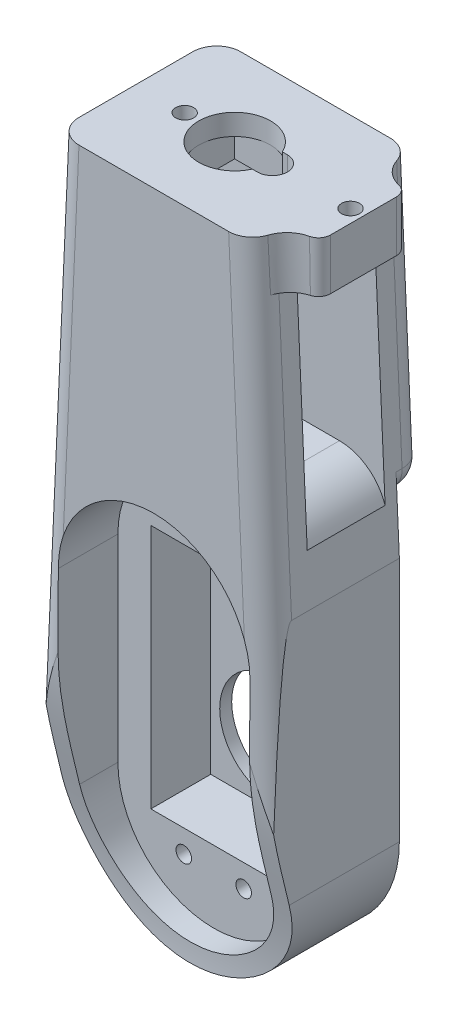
ISO-10303-21;
HEADER;
FILE_DESCRIPTION(('STEP AP214'),'2;1');
FILE_NAME('part.step','',(''),(''),'','','');
FILE_SCHEMA(('AUTOMOTIVE_DESIGN { 1 0 10303 214 1 1 1 1 }'));
ENDSEC;
DATA;
#1=APPLICATION_CONTEXT('core data for automotive mechanical design processes');
#2=APPLICATION_PROTOCOL_DEFINITION('international standard','automotive_design',2000,#1);
#3=PRODUCT_CONTEXT('',#1,'mechanical');
#4=PRODUCT('Part','Part','',(#3));
#5=PRODUCT_RELATED_PRODUCT_CATEGORY('part','',(#4));
#6=PRODUCT_DEFINITION_FORMATION('','',#4);
#7=PRODUCT_DEFINITION_CONTEXT('part definition',#1,'design');
#8=PRODUCT_DEFINITION('design','',#6,#7);
#9=PRODUCT_DEFINITION_SHAPE('','',#8);
#10=(LENGTH_UNIT() NAMED_UNIT(*) SI_UNIT(.MILLI.,.METRE.));
#11=(NAMED_UNIT(*) PLANE_ANGLE_UNIT() SI_UNIT($,.RADIAN.));
#12=(NAMED_UNIT(*) SI_UNIT($,.STERADIAN.) SOLID_ANGLE_UNIT());
#13=UNCERTAINTY_MEASURE_WITH_UNIT(LENGTH_MEASURE(1.E-05),#10,'distance_accuracy_value','');
#14=(GEOMETRIC_REPRESENTATION_CONTEXT(3) GLOBAL_UNCERTAINTY_ASSIGNED_CONTEXT((#13)) GLOBAL_UNIT_ASSIGNED_CONTEXT((#10,
#11,#12)) REPRESENTATION_CONTEXT('',''));
#15=CARTESIAN_POINT('',(0.,0.,0.));
#16=DIRECTION('',(0.,0.,1.));
#17=DIRECTION('',(1.,0.,0.));
#18=AXIS2_PLACEMENT_3D('',#15,#16,#17);
#19=CARTESIAN_POINT('',(-5.,-0.2,2.));
#20=DIRECTION('',(0.,0.,1.));
#21=DIRECTION('',(1.,0.,0.));
#22=AXIS2_PLACEMENT_3D('',#19,#20,#21);
#23=CYLINDRICAL_SURFACE('',#22,1.3);
#24=CARTESIAN_POINT('',(-5.,-0.2,9.));
#25=DIRECTION('',(0.,0.,-1.));
#26=DIRECTION('',(-1.,0.,0.));
#27=AXIS2_PLACEMENT_3D('',#24,#25,#26);
#28=CIRCLE('',#27,1.3);
#29=CARTESIAN_POINT('',(-6.3,-0.2,9.));
#30=VERTEX_POINT('',#29);
#31=EDGE_CURVE('E510',#30,#30,#28,.F.);
#32=ORIENTED_EDGE('',*,*,#31,.T.);
#33=EDGE_LOOP('',(#32));
#34=FACE_BOUND('',#33,.T.);
#35=CARTESIAN_POINT('',(-5.,-0.2,-3.));
#36=DIRECTION('',(0.,0.,-1.));
#37=DIRECTION('',(-1.,0.,0.));
#38=AXIS2_PLACEMENT_3D('',#35,#36,#37);
#39=CIRCLE('',#38,1.3);
#40=CARTESIAN_POINT('',(-6.3,-0.2,-3.));
#41=VERTEX_POINT('',#40);
#42=EDGE_CURVE('E391',#41,#41,#39,.T.);
#43=ORIENTED_EDGE('',*,*,#42,.T.);
#44=EDGE_LOOP('',(#43));
#45=FACE_BOUND('',#44,.T.);
#46=ADVANCED_FACE('F50',(#34,#45),#23,.F.);
#47=CARTESIAN_POINT('',(5.,-0.2,2.));
#48=DIRECTION('',(0.,0.,1.));
#49=DIRECTION('',(1.,0.,0.));
#50=AXIS2_PLACEMENT_3D('',#47,#48,#49);
#51=CYLINDRICAL_SURFACE('',#50,1.3);
#52=CARTESIAN_POINT('',(5.,-0.2,9.));
#53=DIRECTION('',(0.,0.,-1.));
#54=DIRECTION('',(-1.,0.,0.));
#55=AXIS2_PLACEMENT_3D('',#52,#53,#54);
#56=CIRCLE('',#55,1.3);
#57=CARTESIAN_POINT('',(3.7,-0.2,9.));
#58=VERTEX_POINT('',#57);
#59=EDGE_CURVE('E505',#58,#58,#56,.F.);
#60=ORIENTED_EDGE('',*,*,#59,.T.);
#61=EDGE_LOOP('',(#60));
#62=FACE_BOUND('',#61,.T.);
#63=CARTESIAN_POINT('',(5.,-0.2,-3.));
#64=DIRECTION('',(0.,0.,-1.));
#65=DIRECTION('',(-1.,0.,0.));
#66=AXIS2_PLACEMENT_3D('',#63,#64,#65);
#67=CIRCLE('',#66,1.3);
#68=CARTESIAN_POINT('',(3.7,-0.2,-3.));
#69=VERTEX_POINT('',#68);
#70=EDGE_CURVE('E394',#69,#69,#67,.T.);
#71=ORIENTED_EDGE('',*,*,#70,.T.);
#72=EDGE_LOOP('',(#71));
#73=FACE_BOUND('',#72,.T.);
#74=ADVANCED_FACE('F877',(#62,#73),#51,.F.);
#75=CARTESIAN_POINT('',(5.0000000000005,-48.8,2.));
#76=DIRECTION('',(0.,0.,1.));
#77=DIRECTION('',(1.,0.,0.));
#78=AXIS2_PLACEMENT_3D('',#75,#76,#77);
#79=CYLINDRICAL_SURFACE('',#78,1.3);
#80=CARTESIAN_POINT('',(5.0000000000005,-48.8,9.));
#81=DIRECTION('',(0.,0.,-1.));
#82=DIRECTION('',(-1.,0.,0.));
#83=AXIS2_PLACEMENT_3D('',#80,#81,#82);
#84=CIRCLE('',#83,1.3);
#85=CARTESIAN_POINT('',(3.7000000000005,-48.8,9.));
#86=VERTEX_POINT('',#85);
#87=EDGE_CURVE('E502',#86,#86,#84,.F.);
#88=ORIENTED_EDGE('',*,*,#87,.T.);
#89=EDGE_LOOP('',(#88));
#90=FACE_BOUND('',#89,.T.);
#91=CARTESIAN_POINT('',(5.0000000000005,-48.8,-3.));
#92=DIRECTION('',(0.,0.,-1.));
#93=DIRECTION('',(-1.,0.,0.));
#94=AXIS2_PLACEMENT_3D('',#91,#92,#93);
#95=CIRCLE('',#94,1.3);
#96=CARTESIAN_POINT('',(3.7000000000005,-48.8,-3.));
#97=VERTEX_POINT('',#96);
#98=EDGE_CURVE('E903',#97,#97,#95,.T.);
#99=ORIENTED_EDGE('',*,*,#98,.T.);
#100=EDGE_LOOP('',(#99));
#101=FACE_BOUND('',#100,.T.);
#102=ADVANCED_FACE('F883',(#90,#101),#79,.F.);
#103=CARTESIAN_POINT('',(0.,0.,9.));
#104=DIRECTION('',(0.,0.,-1.));
#105=DIRECTION('',(-1.,0.,0.));
#106=AXIS2_PLACEMENT_3D('',#103,#104,#105);
#107=PLANE('',#106);
#108=ORIENTED_EDGE('',*,*,#31,.F.);
#109=EDGE_LOOP('',(#108));
#110=FACE_BOUND('',#109,.T.);
#111=ORIENTED_EDGE('',*,*,#59,.F.);
#112=EDGE_LOOP('',(#111));
#113=FACE_BOUND('',#112,.T.);
#114=ORIENTED_EDGE('',*,*,#87,.F.);
#115=EDGE_LOOP('',(#114));
#116=FACE_BOUND('',#115,.T.);
#117=CARTESIAN_POINT('',(0.,-8.,9.));
#118=DIRECTION('',(0.,0.,-1.));
#119=DIRECTION('',(-1.,0.,0.));
#120=AXIS2_PLACEMENT_3D('',#117,#118,#119);
#121=CIRCLE('',#120,16.);
#122=CARTESIAN_POINT('',(16.,-8.,9.));
#123=VERTEX_POINT('',#122);
#124=CARTESIAN_POINT('',(0.,8.,8.99999999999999));
#125=VERTEX_POINT('',#124);
#126=EDGE_CURVE('E486',#123,#125,#121,.F.);
#127=ORIENTED_EDGE('',*,*,#126,.T.);
#128=CARTESIAN_POINT('',(0.,-8.,8.99999999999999));
#129=DIRECTION('',(0.,0.,-1.));
#130=DIRECTION('',(-1.,0.,0.));
#131=AXIS2_PLACEMENT_3D('',#128,#129,#130);
#132=CIRCLE('',#131,16.);
#133=CARTESIAN_POINT('',(-16.,-8.,9.));
#134=VERTEX_POINT('',#133);
#135=EDGE_CURVE('E488',#125,#134,#132,.F.);
#136=ORIENTED_EDGE('',*,*,#135,.T.);
#137=DIRECTION('',(0.,-1.,0.));
#138=VECTOR('',#137,1.);
#139=CARTESIAN_POINT('',(-16.,0.,9.));
#140=LINE('',#139,#138);
#141=CARTESIAN_POINT('',(-16.,-41.,9.));
#142=VERTEX_POINT('',#141);
#143=EDGE_CURVE('E493',#134,#142,#140,.T.);
#144=ORIENTED_EDGE('',*,*,#143,.T.);
#145=CARTESIAN_POINT('',(0.,-41.,9.));
#146=DIRECTION('',(0.,0.,-1.));
#147=DIRECTION('',(-1.,0.,0.));
#148=AXIS2_PLACEMENT_3D('',#145,#146,#147);
#149=CIRCLE('',#148,16.);
#150=CARTESIAN_POINT('',(16.,-41.,9.));
#151=VERTEX_POINT('',#150);
#152=EDGE_CURVE('E494',#142,#151,#149,.F.);
#153=ORIENTED_EDGE('',*,*,#152,.T.);
#154=DIRECTION('',(0.,1.,0.));
#155=VECTOR('',#154,1.);
#156=CARTESIAN_POINT('',(16.,0.,9.));
#157=LINE('',#156,#155);
#158=EDGE_CURVE('E490',#151,#123,#157,.T.);
#159=ORIENTED_EDGE('',*,*,#158,.T.);
#160=EDGE_LOOP('',(#127,#136,#144,#153,#159));
#161=FACE_BOUND('',#160,.T.);
#162=DIRECTION('',(0.,1.,0.));
#163=VECTOR('',#162,1.);
#164=CARTESIAN_POINT('',(10.5,0.,9.));
#165=LINE('',#164,#163);
#166=CARTESIAN_POINT('',(10.5,-45.,9.));
#167=VERTEX_POINT('',#166);
#168=CARTESIAN_POINT('',(10.5,-4.,9.));
#169=VERTEX_POINT('',#168);
#170=EDGE_CURVE('E475',#167,#169,#165,.T.);
#171=ORIENTED_EDGE('',*,*,#170,.F.);
#172=DIRECTION('',(1.,0.,0.));
#173=VECTOR('',#172,1.);
#174=CARTESIAN_POINT('',(0.,-45.,9.));
#175=LINE('',#174,#173);
#176=CARTESIAN_POINT('',(-10.5,-45.,9.));
#177=VERTEX_POINT('',#176);
#178=EDGE_CURVE('E483',#177,#167,#175,.T.);
#179=ORIENTED_EDGE('',*,*,#178,.F.);
#180=DIRECTION('',(0.,-1.,0.));
#181=VECTOR('',#180,1.);
#182=CARTESIAN_POINT('',(-10.5,0.,9.));
#183=LINE('',#182,#181);
#184=CARTESIAN_POINT('',(-10.5,-4.,9.));
#185=VERTEX_POINT('',#184);
#186=EDGE_CURVE('E480',#185,#177,#183,.T.);
#187=ORIENTED_EDGE('',*,*,#186,.F.);
#188=DIRECTION('',(-1.,0.,0.));
#189=VECTOR('',#188,1.);
#190=CARTESIAN_POINT('',(0.,-4.,9.));
#191=LINE('',#190,#189);
#192=EDGE_CURVE('E477',#169,#185,#191,.T.);
#193=ORIENTED_EDGE('',*,*,#192,.F.);
#194=EDGE_LOOP('',(#171,#179,#187,#193));
#195=FACE_BOUND('',#194,.T.);
#196=CARTESIAN_POINT('',(-4.9999999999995,-48.8,9.));
#197=DIRECTION('',(0.,0.,-1.));
#198=DIRECTION('',(-1.,0.,0.));
#199=AXIS2_PLACEMENT_3D('',#196,#197,#198);
#200=CIRCLE('',#199,1.3);
#201=CARTESIAN_POINT('',(-6.2999999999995,-48.8,9.));
#202=VERTEX_POINT('',#201);
#203=EDGE_CURVE('E465',#202,#202,#200,.T.);
#204=ORIENTED_EDGE('',*,*,#203,.T.);
#205=EDGE_LOOP('',(#204));
#206=FACE_BOUND('',#205,.T.);
#207=ADVANCED_FACE('F598',(#110,#113,#116,#161,#195,#206),#107,.F.);
#208=CARTESIAN_POINT('',(19.35,55.,5.5));
#209=DIRECTION('',(0.,1.,0.));
#210=DIRECTION('',(0.,0.,1.));
#211=AXIS2_PLACEMENT_3D('',#208,#209,#210);
#212=CYLINDRICAL_SURFACE('',#211,0.799999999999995);
#213=CARTESIAN_POINT('',(19.35,46.5,5.5));
#214=DIRECTION('',(0.,-1.,0.));
#215=DIRECTION('',(0.,0.,-1.));
#216=AXIS2_PLACEMENT_3D('',#213,#214,#215);
#217=CIRCLE('',#216,0.799999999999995);
#218=CARTESIAN_POINT('',(19.35,46.5,4.7));
#219=VERTEX_POINT('',#218);
#220=EDGE_CURVE('E412',#219,#219,#217,.T.);
#221=ORIENTED_EDGE('',*,*,#220,.T.);
#222=EDGE_LOOP('',(#221));
#223=FACE_BOUND('',#222,.T.);
#224=CARTESIAN_POINT('',(19.35,52.,5.5));
#225=DIRECTION('',(0.,1.,0.));
#226=DIRECTION('',(0.,0.,1.));
#227=AXIS2_PLACEMENT_3D('',#224,#225,#226);
#228=CIRCLE('',#227,0.799999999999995);
#229=CARTESIAN_POINT('',(19.35,52.,6.29999999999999));
#230=VERTEX_POINT('',#229);
#231=EDGE_CURVE('E470',#230,#230,#228,.F.);
#232=ORIENTED_EDGE('',*,*,#231,.F.);
#233=EDGE_LOOP('',(#232));
#234=FACE_BOUND('',#233,.T.);
#235=ADVANCED_FACE('F897',(#223,#234),#212,.F.);
#236=CARTESIAN_POINT('',(-8.35000000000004,55.,5.5));
#237=DIRECTION('',(0.,1.,0.));
#238=DIRECTION('',(0.,0.,1.));
#239=AXIS2_PLACEMENT_3D('',#236,#237,#238);
#240=CYLINDRICAL_SURFACE('',#239,0.799999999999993);
#241=CARTESIAN_POINT('',(-8.35000000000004,46.5,5.5));
#242=DIRECTION('',(0.,-1.,0.));
#243=DIRECTION('',(0.,0.,-1.));
#244=AXIS2_PLACEMENT_3D('',#241,#242,#243);
#245=CIRCLE('',#244,0.799999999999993);
#246=CARTESIAN_POINT('',(-8.35000000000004,46.5,4.70000000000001));
#247=VERTEX_POINT('',#246);
#248=EDGE_CURVE('E416',#247,#247,#245,.T.);
#249=ORIENTED_EDGE('',*,*,#248,.T.);
#250=EDGE_LOOP('',(#249));
#251=FACE_BOUND('',#250,.T.);
#252=CARTESIAN_POINT('',(-8.35000000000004,52.,5.5));
#253=DIRECTION('',(0.,1.,0.));
#254=DIRECTION('',(0.,0.,1.));
#255=AXIS2_PLACEMENT_3D('',#252,#253,#254);
#256=CIRCLE('',#255,0.799999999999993);
#257=CARTESIAN_POINT('',(-8.35000000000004,52.,6.29999999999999));
#258=VERTEX_POINT('',#257);
#259=EDGE_CURVE('E402',#258,#258,#256,.F.);
#260=ORIENTED_EDGE('',*,*,#259,.F.);
#261=EDGE_LOOP('',(#260));
#262=FACE_BOUND('',#261,.T.);
#263=ADVANCED_FACE('F720',(#251,#262),#240,.F.);
#264=CARTESIAN_POINT('',(19.,-60.,11.));
#265=DIRECTION('',(-1.,0.,0.));
#266=DIRECTION('',(0.,0.,1.));
#267=AXIS2_PLACEMENT_3D('',#264,#265,#266);
#268=PLANE('',#267);
#269=DIRECTION('',(0.,0.,1.));
#270=VECTOR('',#269,1.);
#271=CARTESIAN_POINT('',(19.,0.,-8.));
#272=LINE('',#271,#270);
#273=CARTESIAN_POINT('',(19.,0.,-3.));
#274=VERTEX_POINT('',#273);
#275=CARTESIAN_POINT('',(19.,0.,15.));
#276=VERTEX_POINT('',#275);
#277=EDGE_CURVE('E959',#274,#276,#272,.T.);
#278=ORIENTED_EDGE('',*,*,#277,.T.);
#279=CARTESIAN_POINT('',(19.,-88.0908621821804,15.));
#280=DIRECTION('',(-1.,0.,0.));
#281=DIRECTION('',(0.,1.,0.));
#282=AXIS2_PLACEMENT_3D('',#279,#280,#281);
#283=ELLIPSE('',#282,88.0908621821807,4.);
#284=CARTESIAN_POINT('',(19.,-29.5685503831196,17.9897208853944));
#285=VERTEX_POINT('',#284);
#286=EDGE_CURVE('E841',#276,#285,#283,.F.);
#287=ORIENTED_EDGE('',*,*,#286,.T.);
#288=CARTESIAN_POINT('',(19.,-20.,19.));
#289=CARTESIAN_POINT('',(19.,-33.617507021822,18.8828034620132));
#290=CARTESIAN_POINT('',(19.,-46.256292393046,12.1747842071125));
#291=CARTESIAN_POINT('',(19.,-60.,13.));
#292=B_SPLINE_CURVE_WITH_KNOTS('',3,(#288,#289,#290,#291),.UNSPECIFIED.,.F.,.F.,(4,4),(0.,1.),.UNSPECIFIED.);
#293=CARTESIAN_POINT('',(19.,-41.,15.3950504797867));
#294=VERTEX_POINT('',#293);
#295=EDGE_CURVE('E670',#285,#294,#292,.T.);
#296=ORIENTED_EDGE('',*,*,#295,.T.);
#297=DIRECTION('',(0.,0.,-1.));
#298=VECTOR('',#297,1.);
#299=CARTESIAN_POINT('',(19.,-41.,11.));
#300=LINE('',#299,#298);
#301=CARTESIAN_POINT('',(19.,-41.,-3.));
#302=VERTEX_POINT('',#301);
#303=EDGE_CURVE('E745',#294,#302,#300,.T.);
#304=ORIENTED_EDGE('',*,*,#303,.T.);
#305=DIRECTION('',(0.,-1.,0.));
#306=VECTOR('',#305,1.);
#307=CARTESIAN_POINT('',(19.,8.,-3.));
#308=LINE('',#307,#306);
#309=EDGE_CURVE('E928',#274,#302,#308,.T.);
#310=ORIENTED_EDGE('',*,*,#309,.F.);
#311=EDGE_LOOP('',(#278,#287,#296,#304,#310));
#312=FACE_BOUND('',#311,.T.);
#313=ADVANCED_FACE('F716',(#312),#268,.F.);
#314=CARTESIAN_POINT('',(-19.,-60.,11.));
#315=DIRECTION('',(1.,0.,0.));
#316=DIRECTION('',(0.,0.,-1.));
#317=AXIS2_PLACEMENT_3D('',#314,#315,#316);
#318=PLANE('',#317);
#319=CARTESIAN_POINT('',(-19.,-20.,19.));
#320=CARTESIAN_POINT('',(-19.,-33.617507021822,18.8828034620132));
#321=CARTESIAN_POINT('',(-19.,-46.256292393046,12.1747842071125));
#322=CARTESIAN_POINT('',(-19.,-60.,13.));
#323=B_SPLINE_CURVE_WITH_KNOTS('',3,(#319,#320,#321,#322),.UNSPECIFIED.,.F.,.F.,(4,4),(0.,1.),.UNSPECIFIED.);
#324=CARTESIAN_POINT('',(-19.,-29.5685503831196,17.9897208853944));
#325=VERTEX_POINT('',#324);
#326=CARTESIAN_POINT('',(-19.,-41.,15.3950504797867));
#327=VERTEX_POINT('',#326);
#328=EDGE_CURVE('E664',#325,#327,#323,.T.);
#329=ORIENTED_EDGE('',*,*,#328,.F.);
#330=CARTESIAN_POINT('',(-19.,-88.0908621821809,15.));
#331=DIRECTION('',(1.,0.,0.));
#332=DIRECTION('',(0.,-1.,0.));
#333=AXIS2_PLACEMENT_3D('',#330,#331,#332);
#334=ELLIPSE('',#333,88.0908621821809,4.);
#335=CARTESIAN_POINT('',(-19.,0.,15.));
#336=VERTEX_POINT('',#335);
#337=EDGE_CURVE('E834',#325,#336,#334,.F.);
#338=ORIENTED_EDGE('',*,*,#337,.T.);
#339=DIRECTION('',(0.,0.,1.));
#340=VECTOR('',#339,1.);
#341=CARTESIAN_POINT('',(-19.,0.,-8.));
#342=LINE('',#341,#340);
#343=CARTESIAN_POINT('',(-19.,0.,-3.));
#344=VERTEX_POINT('',#343);
#345=EDGE_CURVE('E951',#344,#336,#342,.T.);
#346=ORIENTED_EDGE('',*,*,#345,.F.);
#347=DIRECTION('',(0.,1.,0.));
#348=VECTOR('',#347,1.);
#349=CARTESIAN_POINT('',(-19.,-41.,-3.));
#350=LINE('',#349,#348);
#351=CARTESIAN_POINT('',(-19.,-41.,-3.));
#352=VERTEX_POINT('',#351);
#353=EDGE_CURVE('E936',#352,#344,#350,.T.);
#354=ORIENTED_EDGE('',*,*,#353,.F.);
#355=DIRECTION('',(0.,0.,-1.));
#356=VECTOR('',#355,1.);
#357=CARTESIAN_POINT('',(-19.,-41.,11.));
#358=LINE('',#357,#356);
#359=EDGE_CURVE('E748',#352,#327,#358,.F.);
#360=ORIENTED_EDGE('',*,*,#359,.T.);
#361=EDGE_LOOP('',(#329,#338,#346,#354,#360));
#362=FACE_BOUND('',#361,.T.);
#363=ADVANCED_FACE('F647',(#362),#318,.F.);
#364=CARTESIAN_POINT('',(0.,0.,-8.));
#365=DIRECTION('',(0.,0.,-1.));
#366=DIRECTION('',(-1.,0.,0.));
#367=AXIS2_PLACEMENT_3D('',#364,#365,#366);
#368=PLANE('',#367);
#369=DIRECTION('',(0.0454076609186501,-0.9989685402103,0.));
#370=VECTOR('',#369,1.);
#371=CARTESIAN_POINT('',(14.6404894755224,7.8183693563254,-8.));
#372=LINE('',#371,#370);
#373=CARTESIAN_POINT('',(12.4958699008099,55.,-8.));
#374=VERTEX_POINT('',#373);
#375=CARTESIAN_POINT('',(14.4504153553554,12.,-8.));
#376=VERTEX_POINT('',#375);
#377=EDGE_CURVE('E791',#374,#376,#372,.T.);
#378=ORIENTED_EDGE('',*,*,#377,.T.);
#379=DIRECTION('',(1.,0.,0.));
#380=VECTOR('',#379,1.);
#381=CARTESIAN_POINT('',(0.,12.,-8.));
#382=LINE('',#381,#380);
#383=CARTESIAN_POINT('',(-14.4504153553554,12.,-8.));
#384=VERTEX_POINT('',#383);
#385=EDGE_CURVE('E1092',#376,#384,#382,.F.);
#386=ORIENTED_EDGE('',*,*,#385,.T.);
#387=DIRECTION('',(0.04540766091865,0.9989685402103,0.));
#388=VECTOR('',#387,1.);
#389=CARTESIAN_POINT('',(-12.5041258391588,54.8183693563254,-8.));
#390=LINE('',#389,#388);
#391=CARTESIAN_POINT('',(-12.49586990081,55.,-8.));
#392=VERTEX_POINT('',#391);
#393=EDGE_CURVE('E794',#384,#392,#390,.T.);
#394=ORIENTED_EDGE('',*,*,#393,.T.);
#395=DIRECTION('',(-1.,0.,0.));
#396=VECTOR('',#395,1.);
#397=CARTESIAN_POINT('',(19.,55.,-8.));
#398=LINE('',#397,#396);
#399=EDGE_CURVE('E772',#374,#392,#398,.T.);
#400=ORIENTED_EDGE('',*,*,#399,.F.);
#401=EDGE_LOOP('',(#378,#386,#394,#400));
#402=FACE_BOUND('',#401,.T.);
#403=ADVANCED_FACE('F643',(#402),#368,.T.);
#404=CARTESIAN_POINT('',(16.,-41.,19.));
#405=DIRECTION('',(-1.,0.,0.));
#406=DIRECTION('',(0.,-1.,0.));
#407=AXIS2_PLACEMENT_3D('',#404,#405,#406);
#408=PLANE('',#407);
#409=CARTESIAN_POINT('',(16.,-20.,19.));
#410=CARTESIAN_POINT('',(16.,-33.617507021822,18.8828034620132));
#411=CARTESIAN_POINT('',(16.,-46.256292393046,12.1747842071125));
#412=CARTESIAN_POINT('',(16.,-60.,13.));
#413=B_SPLINE_CURVE_WITH_KNOTS('',3,(#409,#410,#411,#412),.UNSPECIFIED.,.F.,.F.,(4,4),(0.,1.),.UNSPECIFIED.);
#414=CARTESIAN_POINT('',(16.,-41.,15.3950504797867));
#415=VERTEX_POINT('',#414);
#416=CARTESIAN_POINT('',(16.,-20.1035352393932,18.9989819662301));
#417=VERTEX_POINT('',#416);
#418=EDGE_CURVE('E684',#415,#417,#413,.F.);
#419=ORIENTED_EDGE('',*,*,#418,.T.);
#420=CARTESIAN_POINT('',(16.,-22.0908621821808,15.));
#421=DIRECTION('',(-1.,0.,0.));
#422=DIRECTION('',(0.,1.,0.));
#423=AXIS2_PLACEMENT_3D('',#420,#421,#422);
#424=ELLIPSE('',#423,88.0908621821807,4.);
#425=CARTESIAN_POINT('',(16.,-8.,18.9484951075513));
#426=VERTEX_POINT('',#425);
#427=EDGE_CURVE('E843',#417,#426,#424,.T.);
#428=ORIENTED_EDGE('',*,*,#427,.T.);
#429=DIRECTION('',(0.,0.,-1.));
#430=VECTOR('',#429,1.);
#431=CARTESIAN_POINT('',(16.,-8.,19.));
#432=LINE('',#431,#430);
#433=EDGE_CURVE('E760',#426,#123,#432,.T.);
#434=ORIENTED_EDGE('',*,*,#433,.T.);
#435=ORIENTED_EDGE('',*,*,#158,.F.);
#436=DIRECTION('',(0.,0.,-1.));
#437=VECTOR('',#436,1.);
#438=CARTESIAN_POINT('',(16.,-41.,19.));
#439=LINE('',#438,#437);
#440=EDGE_CURVE('E736',#415,#151,#439,.T.);
#441=ORIENTED_EDGE('',*,*,#440,.F.);
#442=EDGE_LOOP('',(#419,#428,#434,#435,#441));
#443=FACE_BOUND('',#442,.T.);
#444=ADVANCED_FACE('F646',(#443),#408,.T.);
#445=CARTESIAN_POINT('',(-16.,57.,19.));
#446=DIRECTION('',(1.,0.,0.));
#447=DIRECTION('',(0.,1.,0.));
#448=AXIS2_PLACEMENT_3D('',#445,#446,#447);
#449=PLANE('',#448);
#450=DIRECTION('',(0.,0.,-1.));
#451=VECTOR('',#450,1.);
#452=CARTESIAN_POINT('',(-16.,-8.,19.));
#453=LINE('',#452,#451);
#454=CARTESIAN_POINT('',(-16.,-8.,18.9484951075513));
#455=VERTEX_POINT('',#454);
#456=EDGE_CURVE('E501',#134,#455,#453,.F.);
#457=ORIENTED_EDGE('',*,*,#456,.T.);
#458=CARTESIAN_POINT('',(-16.,-22.090862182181,15.));
#459=DIRECTION('',(1.,0.,0.));
#460=DIRECTION('',(0.,-1.,0.));
#461=AXIS2_PLACEMENT_3D('',#458,#459,#460);
#462=ELLIPSE('',#461,88.0908621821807,4.);
#463=CARTESIAN_POINT('',(-16.,-20.1035352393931,18.9989819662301));
#464=VERTEX_POINT('',#463);
#465=EDGE_CURVE('E820',#455,#464,#462,.T.);
#466=ORIENTED_EDGE('',*,*,#465,.T.);
#467=CARTESIAN_POINT('',(-16.,-20.,19.));
#468=CARTESIAN_POINT('',(-16.,-33.617507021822,18.8828034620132));
#469=CARTESIAN_POINT('',(-16.,-46.256292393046,12.1747842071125));
#470=CARTESIAN_POINT('',(-16.,-60.,13.));
#471=B_SPLINE_CURVE_WITH_KNOTS('',3,(#467,#468,#469,#470),.UNSPECIFIED.,.F.,.F.,(4,4),(0.,1.),.UNSPECIFIED.);
#472=CARTESIAN_POINT('',(-16.,-41.,15.3950504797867));
#473=VERTEX_POINT('',#472);
#474=EDGE_CURVE('E489',#464,#473,#471,.T.);
#475=ORIENTED_EDGE('',*,*,#474,.T.);
#476=DIRECTION('',(0.,0.,-1.));
#477=VECTOR('',#476,1.);
#478=CARTESIAN_POINT('',(-16.,-41.,19.));
#479=LINE('',#478,#477);
#480=EDGE_CURVE('E499',#473,#142,#479,.T.);
#481=ORIENTED_EDGE('',*,*,#480,.T.);
#482=ORIENTED_EDGE('',*,*,#143,.F.);
#483=EDGE_LOOP('',(#457,#466,#475,#481,#482));
#484=FACE_BOUND('',#483,.T.);
#485=ADVANCED_FACE('F659',(#484),#449,.T.);
#486=CARTESIAN_POINT('',(0.,-41.,11.));
#487=DIRECTION('',(0.,0.,-1.));
#488=DIRECTION('',(-1.,0.,0.));
#489=AXIS2_PLACEMENT_3D('',#486,#487,#488);
#490=CYLINDRICAL_SURFACE('',#489,19.);
#491=ORIENTED_EDGE('',*,*,#359,.F.);
#492=CARTESIAN_POINT('',(0.,-41.,-3.));
#493=DIRECTION('',(0.,0.,-1.));
#494=DIRECTION('',(-1.,0.,0.));
#495=AXIS2_PLACEMENT_3D('',#492,#493,#494);
#496=CIRCLE('',#495,19.);
#497=EDGE_CURVE('E934',#302,#352,#496,.T.);
#498=ORIENTED_EDGE('',*,*,#497,.F.);
#499=ORIENTED_EDGE('',*,*,#303,.F.);
#500=CARTESIAN_POINT('',(19.,-41.,15.3950504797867));
#501=CARTESIAN_POINT('',(19.0000044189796,-41.3510860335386,15.3112491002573));
#502=CARTESIAN_POINT('',(18.990268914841,-41.7023212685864,15.2280432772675));
#503=CARTESIAN_POINT('',(18.9512957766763,-42.4042562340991,15.0635477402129));
#504=CARTESIAN_POINT('',(18.9220529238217,-42.7549557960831,14.9822585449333));
#505=CARTESIAN_POINT('',(18.8440396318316,-43.4548248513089,14.8223604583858));
#506=CARTESIAN_POINT('',(18.7952676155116,-43.8039942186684,14.7437517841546));
#507=CARTESIAN_POINT('',(18.6781400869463,-44.5002674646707,14.5898241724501));
#508=CARTESIAN_POINT('',(18.6097586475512,-44.8473679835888,14.5145097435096));
#509=CARTESIAN_POINT('',(18.4535077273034,-45.5379934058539,14.3679452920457));
#510=CARTESIAN_POINT('',(18.3656399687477,-45.8815186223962,14.2966949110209));
#511=CARTESIAN_POINT('',(18.1705323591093,-46.5639642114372,14.1588415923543));
#512=CARTESIAN_POINT('',(18.0632929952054,-46.9028846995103,14.0922385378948));
#513=CARTESIAN_POINT('',(17.8293722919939,-47.5757602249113,13.964045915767));
#514=CARTESIAN_POINT('',(17.7026497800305,-47.9097030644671,13.9024673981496));
#515=CARTESIAN_POINT('',(17.4301854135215,-48.5707627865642,13.7848907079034));
#516=CARTESIAN_POINT('',(17.2844427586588,-48.8978793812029,13.7288927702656));
#517=CARTESIAN_POINT('',(16.9742866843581,-49.5441234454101,13.622778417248));
#518=CARTESIAN_POINT('',(16.8098731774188,-49.8632508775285,13.5726620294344));
#519=CARTESIAN_POINT('',(16.4630134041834,-50.4919941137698,13.4785424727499));
#520=CARTESIAN_POINT('',(16.2805880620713,-50.8016204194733,13.4345323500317));
#521=CARTESIAN_POINT('',(15.8980700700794,-51.4106026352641,13.352607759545));
#522=CARTESIAN_POINT('',(15.6979774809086,-51.709958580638,13.3146932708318));
#523=CARTESIAN_POINT('',(15.2807709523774,-52.297248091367,13.2448841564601));
#524=CARTESIAN_POINT('',(15.0636577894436,-52.5851821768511,13.2129892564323));
#525=CARTESIAN_POINT('',(14.5132863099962,-53.2733550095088,13.1421853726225));
#526=CARTESIAN_POINT('',(14.1711608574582,-53.6668811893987,13.1064220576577));
#527=CARTESIAN_POINT('',(13.4552866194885,-54.4248684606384,13.0460170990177));
#528=CARTESIAN_POINT('',(13.0815385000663,-54.7893301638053,13.0213752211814));
#529=CARTESIAN_POINT('',(12.304846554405,-55.4866570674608,12.9817656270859));
#530=CARTESIAN_POINT('',(11.9018891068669,-55.8195073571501,12.9668024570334));
#531=CARTESIAN_POINT('',(11.0697902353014,-56.4509724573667,12.9448431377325));
#532=CARTESIAN_POINT('',(10.6406485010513,-56.7495868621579,12.937847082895));
#533=CARTESIAN_POINT('',(9.75936751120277,-57.3103468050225,12.9299252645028));
#534=CARTESIAN_POINT('',(9.30723777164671,-57.5725072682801,12.9289970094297));
#535=CARTESIAN_POINT('',(8.38293833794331,-58.0586935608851,12.931266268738));
#536=CARTESIAN_POINT('',(7.91076873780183,-58.2827195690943,12.934463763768));
#537=CARTESIAN_POINT('',(6.94964666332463,-58.6910999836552,12.9431244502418));
#538=CARTESIAN_POINT('',(6.46069570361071,-58.8754579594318,12.9485874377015));
#539=CARTESIAN_POINT('',(5.46927659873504,-59.2032859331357,12.960107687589));
#540=CARTESIAN_POINT('',(4.96680826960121,-59.3467553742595,12.966164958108));
#541=CARTESIAN_POINT('',(3.9410824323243,-59.5944086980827,12.9776013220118));
#542=CARTESIAN_POINT('',(3.41760994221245,-59.6977039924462,12.9829634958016));
#543=CARTESIAN_POINT('',(2.36381301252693,-59.8599203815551,12.9917609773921));
#544=CARTESIAN_POINT('',(1.83348848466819,-59.9188409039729,12.9951962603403));
#545=CARTESIAN_POINT('',(0.769733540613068,-59.9918862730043,12.9994959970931));
#546=CARTESIAN_POINT('',(0.236303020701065,-60.0060096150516,13.0003603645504));
#547=CARTESIAN_POINT('',(-0.829851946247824,-59.9893545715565,12.9993614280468));
#548=CARTESIAN_POINT('',(-1.36257639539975,-59.9585763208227,12.9974981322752));
#549=CARTESIAN_POINT('',(-2.42387805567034,-59.8523052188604,12.9913819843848));
#550=CARTESIAN_POINT('',(-2.95245238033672,-59.7767836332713,12.9871275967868));
#551=CARTESIAN_POINT('',(-4.00135949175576,-59.5815420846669,12.9770471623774));
#552=CARTESIAN_POINT('',(-4.52169225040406,-59.4618219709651,12.9712211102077));
#553=CARTESIAN_POINT('',(-5.55048912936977,-59.1790181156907,12.9592476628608));
#554=CARTESIAN_POINT('',(-6.0589520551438,-59.0159300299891,12.9531002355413));
#555=CARTESIAN_POINT('',(-7.06036726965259,-58.6475451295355,12.9420964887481));
#556=CARTESIAN_POINT('',(-7.55331953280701,-58.4422482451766,12.9372401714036));
#557=CARTESIAN_POINT('',(-8.52094043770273,-57.9905583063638,12.9306933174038));
#558=CARTESIAN_POINT('',(-8.99558087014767,-57.7441047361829,12.9290074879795));
#559=CARTESIAN_POINT('',(-9.9224031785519,-57.2120764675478,12.930860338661));
#560=CARTESIAN_POINT('',(-10.3745850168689,-56.9265017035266,12.9343990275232));
#561=CARTESIAN_POINT('',(-11.2531235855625,-56.3183734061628,12.9487721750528));
#562=CARTESIAN_POINT('',(-11.6794850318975,-55.995826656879,12.9596052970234));
#563=CARTESIAN_POINT('',(-12.5033267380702,-55.3161438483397,12.9905257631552));
#564=CARTESIAN_POINT('',(-12.9008074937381,-54.9590083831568,13.0106129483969));
#565=CARTESIAN_POINT('',(-13.6594706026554,-54.2172986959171,13.0614452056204));
#566=CARTESIAN_POINT('',(-14.021023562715,-53.8330948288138,13.0920626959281));
#567=CARTESIAN_POINT('',(-14.7104422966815,-53.0366230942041,13.16526919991));
#568=CARTESIAN_POINT('',(-15.0383082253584,-52.6243553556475,13.2078581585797));
#569=CARTESIAN_POINT('',(-15.6580661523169,-51.7750330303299,13.3057974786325));
#570=CARTESIAN_POINT('',(-15.9499575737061,-51.3379780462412,13.3611480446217));
#571=CARTESIAN_POINT('',(-16.4958362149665,-50.4425797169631,13.4848465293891));
#572=CARTESIAN_POINT('',(-16.7498246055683,-49.9842370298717,13.5531940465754));
#573=CARTESIAN_POINT('',(-17.2141024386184,-49.0584080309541,13.7011747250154));
#574=CARTESIAN_POINT('',(-17.4251077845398,-48.5912435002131,13.7805779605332));
#575=CARTESIAN_POINT('',(-17.8081349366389,-47.6431727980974,13.9507431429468));
#576=CARTESIAN_POINT('',(-17.9801536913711,-47.1622655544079,14.0415059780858));
#577=CARTESIAN_POINT('',(-18.284431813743,-46.1902600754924,14.2330347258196));
#578=CARTESIAN_POINT('',(-18.4167098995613,-45.6991667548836,14.3337958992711));
#579=CARTESIAN_POINT('',(-18.6411997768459,-44.7098361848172,14.5436432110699));
#580=CARTESIAN_POINT('',(-18.7334245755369,-44.211601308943,14.652726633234));
#581=CARTESIAN_POINT('',(-18.8704776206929,-43.2609761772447,14.8660209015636));
#582=CARTESIAN_POINT('',(-18.9191292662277,-42.8089949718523,14.9696246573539));
#583=CARTESIAN_POINT('',(-18.9838579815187,-41.9045927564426,15.1801738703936));
#584=CARTESIAN_POINT('',(-19.000010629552,-41.4521752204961,15.2871109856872));
#585=CARTESIAN_POINT('',(-19.,-41.,15.3950504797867));
#586=B_SPLINE_CURVE_WITH_KNOTS('',3,(#500,#501,#502,#503,#504,#505,#506,#507,#508,#509,#510,
#511,#512,#513,#514,#515,#516,#517,#518,#519,#520,#521,#522,#523,#524,#525,#526,#527,#528,#529,
#530,#531,#532,#533,#534,#535,#536,#537,#538,#539,#540,#541,#542,#543,#544,#545,#546,#547,#548,
#549,#550,#551,#552,#553,#554,#555,#556,#557,#558,#559,#560,#561,#562,#563,#564,#565,#566,#567,
#568,#569,#570,#571,#572,#573,#574,#575,#576,#577,#578,#579,#580,#581,#582,#583,#584,#585),
.UNSPECIFIED.,.F.,.F.,(4,2,2,2,2,2,2,2,2,2,2,2,2,2,2,2,2,2,2,2,2,2,2,2,2,2,2,2,2,2,2,2,2,2,2,2,
2,2,2,2,2,2,4),(0.,1.08272542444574,2.16574062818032,3.24884331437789,4.33338471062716,
5.41783028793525,6.50224859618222,7.58899086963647,8.6757788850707,9.76257199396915,
10.848117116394,11.9336585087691,13.0191504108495,14.5851863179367,16.1511892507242,
17.7179272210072,19.2846837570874,20.8507969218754,22.4169027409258,23.9828675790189,
25.548853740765,27.1477367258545,28.7466403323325,30.3455976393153,31.9445501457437,
33.5445306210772,35.1445165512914,36.7446628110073,38.3448117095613,39.9473344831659,
41.5498599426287,43.1520918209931,44.7542961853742,46.3377353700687,47.9211672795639,
49.5046245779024,51.0880329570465,52.6424064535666,54.196901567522,55.7506633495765,
57.3039201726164,58.701529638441,60.0958851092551),.UNSPECIFIED.);
#587=EDGE_CURVE('E497',#294,#327,#586,.T.);
#588=ORIENTED_EDGE('',*,*,#587,.T.);
#589=EDGE_LOOP('',(#491,#498,#499,#588));
#590=FACE_BOUND('',#589,.T.);
#591=DIRECTION('',(0.,0.,-1.));
#592=VECTOR('',#591,1.);
#593=CARTESIAN_POINT('',(0.,-60.,11.));
#594=LINE('',#593,#592);
#595=CARTESIAN_POINT('',(0.,-60.,11.));
#596=VERTEX_POINT('',#595);
#597=CARTESIAN_POINT('',(0.,-60.,0.));
#598=VERTEX_POINT('',#597);
#599=EDGE_CURVE('E478',#596,#598,#594,.T.);
#600=ORIENTED_EDGE('',*,*,#599,.T.);
#601=ORIENTED_EDGE('',*,*,#599,.F.);
#602=EDGE_LOOP('',(#600,#601));
#603=FACE_BOUND('',#602,.T.);
#604=ADVANCED_FACE('F693',(#590,#603),#490,.T.);
#605=CARTESIAN_POINT('',(0.,-41.,19.));
#606=DIRECTION('',(0.,0.,-1.));
#607=DIRECTION('',(-1.,0.,0.));
#608=AXIS2_PLACEMENT_3D('',#605,#606,#607);
#609=CYLINDRICAL_SURFACE('',#608,16.);
#610=ORIENTED_EDGE('',*,*,#480,.F.);
#611=CARTESIAN_POINT('',(-16.,-41.,15.3950504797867));
#612=CARTESIAN_POINT('',(-16.0000048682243,-41.2987059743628,15.3237526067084));
#613=CARTESIAN_POINT('',(-15.9916352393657,-41.59751898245,15.2528857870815));
#614=CARTESIAN_POINT('',(-15.9581434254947,-42.1945868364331,15.1125197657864));
#615=CARTESIAN_POINT('',(-15.9330180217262,-42.4928415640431,15.0430208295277));
#616=CARTESIAN_POINT('',(-15.8660091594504,-43.087922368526,14.9059199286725));
#617=CARTESIAN_POINT('',(-15.8241247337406,-43.3847483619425,14.838318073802));
#618=CARTESIAN_POINT('',(-15.7235852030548,-43.9764080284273,14.7054359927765));
#619=CARTESIAN_POINT('',(-15.6649125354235,-44.2712392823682,14.6401582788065));
#620=CARTESIAN_POINT('',(-15.530892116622,-44.8576997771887,14.5124610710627));
#621=CARTESIAN_POINT('',(-15.4555455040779,-45.1493292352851,14.4500413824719));
#622=CARTESIAN_POINT('',(-15.2883094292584,-45.7284736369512,14.3284734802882));
#623=CARTESIAN_POINT('',(-15.1964202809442,-46.0159886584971,14.2693252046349));
#624=CARTESIAN_POINT('',(-14.9459531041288,-46.7292564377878,14.1258452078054));
#625=CARTESIAN_POINT('',(-14.7770624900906,-47.1518978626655,14.0437887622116));
#626=CARTESIAN_POINT('',(-14.4031491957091,-47.9826080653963,13.8888510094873));
#627=CARTESIAN_POINT('',(-14.1981256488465,-48.3906764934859,13.8159699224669));
#628=CARTESIAN_POINT('',(-13.7533465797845,-49.1886431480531,13.6800295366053));
#629=CARTESIAN_POINT('',(-13.5136241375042,-49.5785582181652,13.6169610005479));
#630=CARTESIAN_POINT('',(-13.00087402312,-50.3373952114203,13.500760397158));
#631=CARTESIAN_POINT('',(-12.727847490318,-50.706317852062,13.4476279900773));
#632=CARTESIAN_POINT('',(-12.1595336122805,-51.4088125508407,13.3526130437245));
#633=CARTESIAN_POINT('',(-11.8652210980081,-51.7431329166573,13.3104283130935));
#634=CARTESIAN_POINT('',(-11.2492072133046,-52.3865576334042,13.2346576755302));
#635=CARTESIAN_POINT('',(-10.9275063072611,-52.6956624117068,13.2010716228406));
#636=CARTESIAN_POINT('',(-10.2588970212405,-53.2863373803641,13.1416921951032));
#637=CARTESIAN_POINT('',(-9.91198041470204,-53.5678985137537,13.115901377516));
#638=CARTESIAN_POINT('',(-9.19553159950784,-54.1012071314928,13.0711223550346));
#639=CARTESIAN_POINT('',(-8.82599935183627,-54.3529545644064,13.0521341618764));
#640=CARTESIAN_POINT('',(-8.0708185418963,-54.8223571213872,13.0199922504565));
#641=CARTESIAN_POINT('',(-7.68537008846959,-55.0403304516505,13.0067816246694));
#642=CARTESIAN_POINT('',(-6.89764070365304,-55.4436263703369,12.9847801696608));
#643=CARTESIAN_POINT('',(-6.49535993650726,-55.6289492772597,12.9759892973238));
#644=CARTESIAN_POINT('',(-5.67680635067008,-55.9656172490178,12.9617289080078));
#645=CARTESIAN_POINT('',(-5.26053465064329,-56.1169650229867,12.95625912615));
#646=CARTESIAN_POINT('',(-4.41685541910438,-56.3846434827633,12.9476520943));
#647=CARTESIAN_POINT('',(-3.98944776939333,-56.5009737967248,12.9445148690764));
#648=CARTESIAN_POINT('',(-3.12124942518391,-56.6989943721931,12.9397292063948));
#649=CARTESIAN_POINT('',(-2.68035953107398,-56.7802503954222,12.9380991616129));
#650=CARTESIAN_POINT('',(-1.79331370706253,-56.9054916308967,12.9357805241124));
#651=CARTESIAN_POINT('',(-1.34715774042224,-56.9494765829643,12.9350919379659));
#652=CARTESIAN_POINT('',(-0.452703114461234,-56.9998661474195,12.9343145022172));
#653=CARTESIAN_POINT('',(-0.00440433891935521,-57.0062686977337,12.9342256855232));
#654=CARTESIAN_POINT('',(0.891149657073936,-56.9814427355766,12.9345975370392));
#655=CARTESIAN_POINT('',(1.33840487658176,-56.9502141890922,12.9350582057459));
#656=CARTESIAN_POINT('',(2.23048332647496,-56.8501480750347,12.9367764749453));
#657=CARTESIAN_POINT('',(2.67528989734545,-56.7811619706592,12.9380372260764));
#658=CARTESIAN_POINT('',(3.55750886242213,-56.605972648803,12.9418892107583));
#659=CARTESIAN_POINT('',(3.99492122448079,-56.4997692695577,12.944480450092));
#660=CARTESIAN_POINT('',(4.85924602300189,-56.2509010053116,12.9517761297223));
#661=CARTESIAN_POINT('',(5.28615812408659,-56.1082349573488,12.9564806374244));
#662=CARTESIAN_POINT('',(6.12641169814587,-55.787471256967,12.9689885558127));
#663=CARTESIAN_POINT('',(6.53975320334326,-55.6093736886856,12.9767919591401));
#664=CARTESIAN_POINT('',(7.3494403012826,-55.2192631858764,12.9966121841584));
#665=CARTESIAN_POINT('',(7.74580428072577,-55.0072881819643,13.0086243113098));
#666=CARTESIAN_POINT('',(8.51915716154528,-54.5508508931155,13.0380499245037));
#667=CARTESIAN_POINT('',(8.89614607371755,-54.306388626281,13.0554634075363));
#668=CARTESIAN_POINT('',(9.62794562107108,-53.7868677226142,13.0968556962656));
#669=CARTESIAN_POINT('',(9.98275988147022,-53.5118141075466,13.1208334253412));
#670=CARTESIAN_POINT('',(10.6676899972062,-52.9332041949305,13.1764163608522));
#671=CARTESIAN_POINT('',(10.9978061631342,-52.6296482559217,13.2080214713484));
#672=CARTESIAN_POINT('',(11.6276573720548,-51.9997225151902,13.2793554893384));
#673=CARTESIAN_POINT('',(11.9276731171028,-51.6736233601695,13.3189963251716));
#674=CARTESIAN_POINT('',(12.4991112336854,-50.998391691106,13.407187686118));
#675=CARTESIAN_POINT('',(12.7705336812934,-50.649259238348,13.455738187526));
#676=CARTESIAN_POINT('',(13.2830286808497,-49.9306193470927,13.562038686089));
#677=CARTESIAN_POINT('',(13.5240958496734,-49.5611083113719,13.6197903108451));
#678=CARTESIAN_POINT('',(13.9743211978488,-48.8046198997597,13.7444264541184));
#679=CARTESIAN_POINT('',(14.1834800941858,-48.4176429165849,13.8113107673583));
#680=CARTESIAN_POINT('',(14.5680471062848,-47.6304774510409,13.9535615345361));
#681=CARTESIAN_POINT('',(14.7435692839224,-47.2303392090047,14.0288978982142));
#682=CARTESIAN_POINT('',(15.0609061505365,-46.418405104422,14.1875222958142));
#683=CARTESIAN_POINT('',(15.202717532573,-46.0066081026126,14.2708111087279));
#684=CARTESIAN_POINT('',(15.451925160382,-45.1745073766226,14.444257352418));
#685=CARTESIAN_POINT('',(15.5593468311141,-44.7542101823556,14.534409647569));
#686=CARTESIAN_POINT('',(15.7395305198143,-43.9076421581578,14.7203645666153));
#687=CARTESIAN_POINT('',(15.8123053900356,-43.4813736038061,14.8161650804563));
#688=CARTESIAN_POINT('',(15.9118464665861,-42.7121732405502,14.992151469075));
#689=CARTESIAN_POINT('',(15.9449494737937,-42.3698685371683,15.0715648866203));
#690=CARTESIAN_POINT('',(15.9890059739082,-41.6850012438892,15.2321470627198));
#691=CARTESIAN_POINT('',(16.0000054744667,-41.3424406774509,15.3133118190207));
#692=CARTESIAN_POINT('',(16.,-41.,15.3950504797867));
#693=B_SPLINE_CURVE_WITH_KNOTS('',3,(#611,#612,#613,#614,#615,#616,#617,#618,#619,#620,#621,
#622,#623,#624,#625,#626,#627,#628,#629,#630,#631,#632,#633,#634,#635,#636,#637,#638,#639,#640,
#641,#642,#643,#644,#645,#646,#647,#648,#649,#650,#651,#652,#653,#654,#655,#656,#657,#658,#659,
#660,#661,#662,#663,#664,#665,#666,#667,#668,#669,#670,#671,#672,#673,#674,#675,#676,#677,#678,
#679,#680,#681,#682,#683,#684,#685,#686,#687,#688,#689,#690,#691,#692),.UNSPECIFIED.,.F.,.F.,(4,
2,2,2,2,2,2,2,2,2,2,2,2,2,2,2,2,2,2,2,2,2,2,2,2,2,2,2,2,2,2,2,2,2,2,2,2,2,2,2,4),(0.,
0.921183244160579,1.8425434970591,2.76395693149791,3.68633782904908,4.60865575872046,
5.53095618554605,6.91656845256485,8.30221395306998,9.68654705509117,11.0708328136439,
12.411418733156,13.7519819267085,15.0929844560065,16.4339892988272,17.761470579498,
19.088938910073,20.4163013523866,21.7436778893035,23.0870469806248,24.4304254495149,
25.7738776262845,27.1173310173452,28.4661078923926,29.8148906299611,31.1637163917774,
32.5125389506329,33.8598617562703,35.2071838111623,36.5542850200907,37.9013692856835,
39.2344184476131,40.567464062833,41.9007457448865,43.2339974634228,44.5626448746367,
45.8914225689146,47.2192155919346,48.5465156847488,49.604694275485,50.6606680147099),.UNSPECIFIED.);
#694=EDGE_CURVE('E669',#473,#415,#693,.T.);
#695=ORIENTED_EDGE('',*,*,#694,.T.);
#696=ORIENTED_EDGE('',*,*,#440,.T.);
#697=ORIENTED_EDGE('',*,*,#152,.F.);
#698=EDGE_LOOP('',(#610,#695,#696,#697));
#699=FACE_BOUND('',#698,.T.);
#700=ADVANCED_FACE('F688',(#699),#609,.F.);
#701=CARTESIAN_POINT('',(10.5,-45.,11.));
#702=DIRECTION('',(-1.,0.,0.));
#703=DIRECTION('',(0.,0.,1.));
#704=AXIS2_PLACEMENT_3D('',#701,#702,#703);
#705=PLANE('',#704);
#706=DIRECTION('',(0.,0.,-1.));
#707=VECTOR('',#706,1.);
#708=CARTESIAN_POINT('',(10.5,-4.,11.));
#709=LINE('',#708,#707);
#710=CARTESIAN_POINT('',(10.5,-4.,-1.));
#711=VERTEX_POINT('',#710);
#712=EDGE_CURVE('E743',#169,#711,#709,.T.);
#713=ORIENTED_EDGE('',*,*,#712,.T.);
#714=DIRECTION('',(0.,1.,0.));
#715=VECTOR('',#714,1.);
#716=CARTESIAN_POINT('',(10.5,-4.,-1.));
#717=LINE('',#716,#715);
#718=CARTESIAN_POINT('',(10.5,-45.,-1.));
#719=VERTEX_POINT('',#718);
#720=EDGE_CURVE('E419',#719,#711,#717,.T.);
#721=ORIENTED_EDGE('',*,*,#720,.F.);
#722=DIRECTION('',(0.,0.,-1.));
#723=VECTOR('',#722,1.);
#724=CARTESIAN_POINT('',(10.5,-45.,11.));
#725=LINE('',#724,#723);
#726=EDGE_CURVE('E485',#167,#719,#725,.T.);
#727=ORIENTED_EDGE('',*,*,#726,.F.);
#728=ORIENTED_EDGE('',*,*,#170,.T.);
#729=EDGE_LOOP('',(#713,#721,#727,#728));
#730=FACE_BOUND('',#729,.T.);
#731=ADVANCED_FACE('F692',(#730),#705,.T.);
#732=CARTESIAN_POINT('',(-10.5,-4.,11.));
#733=DIRECTION('',(0.,-1.,0.));
#734=DIRECTION('',(0.,0.,-1.));
#735=AXIS2_PLACEMENT_3D('',#732,#733,#734);
#736=PLANE('',#735);
#737=DIRECTION('',(0.,0.,-1.));
#738=VECTOR('',#737,1.);
#739=CARTESIAN_POINT('',(-10.5,-4.,11.));
#740=LINE('',#739,#738);
#741=CARTESIAN_POINT('',(-10.5,-4.,-1.));
#742=VERTEX_POINT('',#741);
#743=EDGE_CURVE('E741',#185,#742,#740,.T.);
#744=ORIENTED_EDGE('',*,*,#743,.T.);
#745=DIRECTION('',(-1.,0.,0.));
#746=VECTOR('',#745,1.);
#747=CARTESIAN_POINT('',(-10.5,-4.,-1.));
#748=LINE('',#747,#746);
#749=EDGE_CURVE('E422',#711,#742,#748,.T.);
#750=ORIENTED_EDGE('',*,*,#749,.F.);
#751=ORIENTED_EDGE('',*,*,#712,.F.);
#752=ORIENTED_EDGE('',*,*,#192,.T.);
#753=EDGE_LOOP('',(#744,#750,#751,#752));
#754=FACE_BOUND('',#753,.T.);
#755=ADVANCED_FACE('F706',(#754),#736,.T.);
#756=CARTESIAN_POINT('',(-10.5,-45.,11.));
#757=DIRECTION('',(1.,0.,0.));
#758=DIRECTION('',(0.,0.,-1.));
#759=AXIS2_PLACEMENT_3D('',#756,#757,#758);
#760=PLANE('',#759);
#761=DIRECTION('',(0.,0.,-1.));
#762=VECTOR('',#761,1.);
#763=CARTESIAN_POINT('',(-10.5,-45.,11.));
#764=LINE('',#763,#762);
#765=CARTESIAN_POINT('',(-10.5,-45.,-1.));
#766=VERTEX_POINT('',#765);
#767=EDGE_CURVE('E739',#177,#766,#764,.T.);
#768=ORIENTED_EDGE('',*,*,#767,.T.);
#769=DIRECTION('',(0.,-1.,0.));
#770=VECTOR('',#769,1.);
#771=CARTESIAN_POINT('',(-10.5,-45.,-1.));
#772=LINE('',#771,#770);
#773=EDGE_CURVE('E425',#742,#766,#772,.T.);
#774=ORIENTED_EDGE('',*,*,#773,.F.);
#775=ORIENTED_EDGE('',*,*,#743,.F.);
#776=ORIENTED_EDGE('',*,*,#186,.T.);
#777=EDGE_LOOP('',(#768,#774,#775,#776));
#778=FACE_BOUND('',#777,.T.);
#779=ADVANCED_FACE('F702',(#778),#760,.T.);
#780=CARTESIAN_POINT('',(-10.5,-45.,11.));
#781=DIRECTION('',(0.,1.,0.));
#782=DIRECTION('',(0.,0.,1.));
#783=AXIS2_PLACEMENT_3D('',#780,#781,#782);
#784=PLANE('',#783);
#785=ORIENTED_EDGE('',*,*,#726,.T.);
#786=DIRECTION('',(1.,0.,0.));
#787=VECTOR('',#786,1.);
#788=CARTESIAN_POINT('',(10.5,-45.,-1.));
#789=LINE('',#788,#787);
#790=EDGE_CURVE('E415',#766,#719,#789,.T.);
#791=ORIENTED_EDGE('',*,*,#790,.F.);
#792=ORIENTED_EDGE('',*,*,#767,.F.);
#793=ORIENTED_EDGE('',*,*,#178,.T.);
#794=EDGE_LOOP('',(#785,#791,#792,#793));
#795=FACE_BOUND('',#794,.T.);
#796=ADVANCED_FACE('F657',(#795),#784,.T.);
#797=DIRECTION('',(1.,0.,0.));
#798=VECTOR('',#797,1.);
#799=SURFACE_OF_LINEAR_EXTRUSION('',#323,#798);
#800=ORIENTED_EDGE('',*,*,#474,.F.);
#801=CARTESIAN_POINT('',(-16.,-20.1035352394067,18.9989819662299));
#802=CARTESIAN_POINT('',(-16.007271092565,-20.1171604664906,18.9988313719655));
#803=CARTESIAN_POINT('',(-16.0142427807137,-20.130937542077,18.9986723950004));
#804=CARTESIAN_POINT('',(-16.0277466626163,-20.1586998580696,18.9983383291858));
#805=CARTESIAN_POINT('',(-16.034279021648,-20.1726850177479,18.9981632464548));
#806=CARTESIAN_POINT('',(-16.0470648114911,-20.2007696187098,18.9977976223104));
#807=CARTESIAN_POINT('',(-16.0533184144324,-20.2148689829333,18.9976070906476));
#808=CARTESIAN_POINT('',(-16.0656241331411,-20.2431569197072,18.9972106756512));
#809=CARTESIAN_POINT('',(-16.0716762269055,-20.2573455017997,18.997004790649));
#810=CARTESIAN_POINT('',(-16.0895970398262,-20.2999685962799,18.996364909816));
#811=CARTESIAN_POINT('',(-16.1012456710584,-20.3284950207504,18.9959082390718));
#812=CARTESIAN_POINT('',(-16.1241879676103,-20.3856941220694,18.9949350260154));
#813=CARTESIAN_POINT('',(-16.1354815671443,-20.4143668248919,18.9944184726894));
#814=CARTESIAN_POINT('',(-16.1578262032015,-20.4718024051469,18.9933260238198));
#815=CARTESIAN_POINT('',(-16.1688772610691,-20.5005652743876,18.9927501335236));
#816=CARTESIAN_POINT('',(-16.1908057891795,-20.5581534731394,18.9915393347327));
#817=CARTESIAN_POINT('',(-16.2016832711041,-20.5869787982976,18.9909044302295));
#818=CARTESIAN_POINT('',(-16.2341135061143,-20.6734964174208,18.9889121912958));
#819=CARTESIAN_POINT('',(-16.2554748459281,-20.7312584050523,18.9874667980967));
#820=CARTESIAN_POINT('',(-16.2978825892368,-20.8469018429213,18.9843427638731));
#821=CARTESIAN_POINT('',(-16.3189289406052,-20.9047833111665,18.9826640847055));
#822=CARTESIAN_POINT('',(-16.3607945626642,-21.0206241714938,18.9790753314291));
#823=CARTESIAN_POINT('',(-16.3816138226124,-21.0785835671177,18.9771652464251));
#824=CARTESIAN_POINT('',(-16.4334237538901,-21.2234938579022,18.9721049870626));
#825=CARTESIAN_POINT('',(-16.4643056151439,-21.3104786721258,18.9688116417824));
#826=CARTESIAN_POINT('',(-16.5257685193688,-21.4845280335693,18.9617150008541));
#827=CARTESIAN_POINT('',(-16.5563495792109,-21.5715925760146,18.9579117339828));
#828=CARTESIAN_POINT('',(-16.6172605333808,-21.7457978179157,18.9498004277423));
#829=CARTESIAN_POINT('',(-16.6475903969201,-21.8329385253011,18.9454923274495));
#830=CARTESIAN_POINT('',(-16.7080187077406,-22.0072755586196,18.9363775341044));
#831=CARTESIAN_POINT('',(-16.7381171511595,-22.0944718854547,18.9315708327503));
#832=CARTESIAN_POINT('',(-16.8280793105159,-22.3561196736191,18.9164124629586));
#833=CARTESIAN_POINT('',(-16.8876140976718,-22.5306420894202,18.9053219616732));
#834=CARTESIAN_POINT('',(-17.0058275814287,-22.8798358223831,18.8812195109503));
#835=CARTESIAN_POINT('',(-17.0645063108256,-23.054507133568,18.868207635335));
#836=CARTESIAN_POINT('',(-17.1808008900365,-23.4034230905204,18.8403568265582));
#837=CARTESIAN_POINT('',(-17.2384195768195,-23.5776672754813,18.8255239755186));
#838=CARTESIAN_POINT('',(-17.3527550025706,-23.9262894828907,18.7940479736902));
#839=CARTESIAN_POINT('',(-17.4094717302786,-24.1006675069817,18.7774048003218));
#840=CARTESIAN_POINT('',(-17.5782122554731,-24.6240128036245,18.7248341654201));
#841=CARTESIAN_POINT('',(-17.6888211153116,-24.9731754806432,18.6862668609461));
#842=CARTESIAN_POINT('',(-17.9058963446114,-25.6719789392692,18.6025162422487));
#843=CARTESIAN_POINT('',(-18.0123628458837,-26.0216197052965,18.5573331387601));
#844=CARTESIAN_POINT('',(-18.1957092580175,-26.6371524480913,18.4724097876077));
#845=CARTESIAN_POINT('',(-18.2735415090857,-26.9029424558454,18.4339778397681));
#846=CARTESIAN_POINT('',(-18.4264620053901,-27.43478569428,18.3537525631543));
#847=CARTESIAN_POINT('',(-18.5015504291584,-27.7008389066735,18.3119594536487));
#848=CARTESIAN_POINT('',(-18.6489691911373,-28.233660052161,18.2251415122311));
#849=CARTESIAN_POINT('',(-18.7212948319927,-28.5004284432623,18.1801115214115));
#850=CARTESIAN_POINT('',(-18.8629371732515,-29.0342670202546,18.087086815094));
#851=CARTESIAN_POINT('',(-18.9322536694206,-29.3013372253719,18.0390918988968));
#852=CARTESIAN_POINT('',(-19.,-29.568550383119,17.9897208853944));
#853=B_SPLINE_CURVE_WITH_KNOTS('',3,(#801,#802,#803,#804,#805,#806,#807,#808,#809,#810,#811,
#812,#813,#814,#815,#816,#817,#818,#819,#820,#821,#822,#823,#824,#825,#826,#827,#828,#829,#830,
#831,#832,#833,#834,#835,#836,#837,#838,#839,#840,#841,#842,#843,#844,#845,#846,#847,#848,#849,
#850,#851,#852),.UNSPECIFIED.,.F.,.F.,(4,2,2,2,2,2,2,2,2,2,2,2,2,2,2,2,2,2,2,2,2,2,2,2,2,4),(0.,
0.04632062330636,0.0926237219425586,0.138897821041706,0.185176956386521,0.277621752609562,
0.370083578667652,0.462537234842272,0.554984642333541,0.739789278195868,0.924624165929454,
1.10946775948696,1.38655401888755,1.6636246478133,1.9407287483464,2.21783746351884,
2.77201626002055,3.3261737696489,3.87852831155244,4.4308897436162,5.53566277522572,
6.64040062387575,7.47918439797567,8.31791349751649,9.15801033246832,9.99816409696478),.UNSPECIFIED.);
#854=EDGE_CURVE('E828',#464,#325,#853,.T.);
#855=ORIENTED_EDGE('',*,*,#854,.T.);
#856=ORIENTED_EDGE('',*,*,#328,.T.);
#857=ORIENTED_EDGE('',*,*,#587,.F.);
#858=ORIENTED_EDGE('',*,*,#295,.F.);
#859=CARTESIAN_POINT('',(19.,-29.568550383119,17.9897208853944));
#860=CARTESIAN_POINT('',(18.8918573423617,-29.1419638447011,18.0685425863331));
#861=CARTESIAN_POINT('',(18.7796977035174,-28.7157404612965,18.1438503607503));
#862=CARTESIAN_POINT('',(18.5478727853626,-27.8639428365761,18.2866117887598));
#863=CARTESIAN_POINT('',(18.4282062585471,-27.4383687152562,18.3540641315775));
#864=CARTESIAN_POINT('',(18.1819261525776,-26.5879134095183,18.4802647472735));
#865=CARTESIAN_POINT('',(18.0553122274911,-26.1630322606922,18.5390125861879));
#866=CARTESIAN_POINT('',(17.7963710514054,-25.3159628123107,18.6467527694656));
#867=CARTESIAN_POINT('',(17.6640730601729,-24.8937711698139,18.6957891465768));
#868=CARTESIAN_POINT('',(17.3938784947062,-24.0501473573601,18.7836889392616));
#869=CARTESIAN_POINT('',(17.2559823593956,-23.6287151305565,18.8225531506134));
#870=CARTESIAN_POINT('',(17.0453580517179,-22.9972041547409,18.8726848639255));
#871=CARTESIAN_POINT('',(16.9745211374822,-22.7868102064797,18.8880344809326));
#872=CARTESIAN_POINT('',(16.8316126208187,-22.366256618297,18.9159274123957));
#873=CARTESIAN_POINT('',(16.7595410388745,-22.1560969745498,18.9284707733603));
#874=CARTESIAN_POINT('',(16.6510923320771,-21.8429699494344,18.9450187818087));
#875=CARTESIAN_POINT('',(16.6152173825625,-21.7398851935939,18.9501200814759));
#876=CARTESIAN_POINT('',(16.5431109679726,-21.5338162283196,18.959615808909));
#877=CARTESIAN_POINT('',(16.5068795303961,-21.4308320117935,18.964010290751));
#878=CARTESIAN_POINT('',(16.4522008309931,-21.2764595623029,18.9700647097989));
#879=CARTESIAN_POINT('',(16.4339204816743,-21.2250225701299,18.9719931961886));
#880=CARTESIAN_POINT('',(16.3972278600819,-21.1221903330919,18.9756699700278));
#881=CARTESIAN_POINT('',(16.3788155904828,-21.0707950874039,18.9774182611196));
#882=CARTESIAN_POINT('',(16.341804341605,-20.9679918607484,18.980735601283));
#883=CARTESIAN_POINT('',(16.3232051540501,-20.9165839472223,18.9823044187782));
#884=CARTESIAN_POINT('',(16.2857895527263,-20.8138378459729,18.9852591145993));
#885=CARTESIAN_POINT('',(16.2669731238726,-20.7624996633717,18.9866449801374));
#886=CARTESIAN_POINT('',(16.2290337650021,-20.6599263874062,18.9892324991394));
#887=CARTESIAN_POINT('',(16.2099108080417,-20.6086913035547,18.9904341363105));
#888=CARTESIAN_POINT('',(16.1808629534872,-20.5319796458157,18.9920971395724));
#889=CARTESIAN_POINT('',(16.1711208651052,-20.5064354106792,18.9926281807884));
#890=CARTESIAN_POINT('',(16.1514722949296,-20.4554073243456,18.9936436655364));
#891=CARTESIAN_POINT('',(16.1415658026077,-20.4299234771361,18.9941281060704));
#892=CARTESIAN_POINT('',(16.1215167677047,-20.3790168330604,18.9950505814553));
#893=CARTESIAN_POINT('',(16.1113739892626,-20.3535941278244,18.9954885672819));
#894=CARTESIAN_POINT('',(16.0907584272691,-20.3028869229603,18.9963171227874));
#895=CARTESIAN_POINT('',(16.0802857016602,-20.2776023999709,18.9967077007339));
#896=CARTESIAN_POINT('',(16.058812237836,-20.2272336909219,18.9974412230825));
#897=CARTESIAN_POINT('',(16.0478111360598,-20.2021496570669,18.9977841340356));
#898=CARTESIAN_POINT('',(16.0306043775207,-20.1648364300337,18.9982616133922));
#899=CARTESIAN_POINT('',(16.0247495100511,-20.1524473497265,18.998414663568));
#900=CARTESIAN_POINT('',(16.0126775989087,-20.1278425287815,18.9987080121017));
#901=CARTESIAN_POINT('',(16.0064604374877,-20.1156268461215,18.9988483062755));
#902=CARTESIAN_POINT('',(16.,-20.1035352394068,18.9989819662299));
#903=B_SPLINE_CURVE_WITH_KNOTS('',3,(#859,#860,#861,#862,#863,#864,#865,#866,#867,#868,#869,
#870,#871,#872,#873,#874,#875,#876,#877,#878,#879,#880,#881,#882,#883,#884,#885,#886,#887,#888,
#889,#890,#891,#892,#893,#894,#895,#896,#897,#898,#899,#900,#901,#902),.UNSPECIFIED.,.F.,.F.,(4,
2,2,2,2,2,2,2,2,2,2,2,2,2,2,2,2,2,2,2,2,4),(0.,1.34122754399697,2.6826785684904,
4.02419644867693,5.35948501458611,6.69466908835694,7.36223898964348,8.02979782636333,
8.35759975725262,8.68537659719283,8.84924474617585,9.01310958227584,9.17718352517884,
9.3412689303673,9.50536883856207,9.58740061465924,9.66943766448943,9.75156044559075,
9.83366888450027,9.91583465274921,9.95694090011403,9.99806058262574),.UNSPECIFIED.);
#904=EDGE_CURVE('E822',#285,#417,#903,.T.);
#905=ORIENTED_EDGE('',*,*,#904,.T.);
#906=ORIENTED_EDGE('',*,*,#418,.F.);
#907=ORIENTED_EDGE('',*,*,#694,.F.);
#908=EDGE_LOOP('',(#800,#855,#856,#857,#858,#905,#906,#907));
#909=FACE_BOUND('',#908,.T.);
#910=ADVANCED_FACE('F651',(#909),#799,.T.);
#911=CARTESIAN_POINT('',(0.,8.,-8.));
#912=DIRECTION('',(0.,-1.,0.));
#913=DIRECTION('',(1.,0.,0.));
#914=AXIS2_PLACEMENT_3D('',#911,#912,#913);
#915=PLANE('',#914);
#916=DIRECTION('',(1.,0.,0.));
#917=VECTOR('',#916,1.);
#918=CARTESIAN_POINT('',(-19.,8.,-3.));
#919=LINE('',#918,#917);
#920=CARTESIAN_POINT('',(-14.4504153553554,8.,-3.));
#921=VERTEX_POINT('',#920);
#922=CARTESIAN_POINT('',(14.4504153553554,8.,-3.));
#923=VERTEX_POINT('',#922);
#924=EDGE_CURVE('E925',#921,#923,#919,.T.);
#925=ORIENTED_EDGE('',*,*,#924,.F.);
#926=DIRECTION('',(0.,0.,1.));
#927=VECTOR('',#926,1.);
#928=CARTESIAN_POINT('',(-14.4504153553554,8.,-4.));
#929=LINE('',#928,#927);
#930=CARTESIAN_POINT('',(-14.4504153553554,8.,-4.));
#931=VERTEX_POINT('',#930);
#932=EDGE_CURVE('E1124',#921,#931,#929,.F.);
#933=ORIENTED_EDGE('',*,*,#932,.T.);
#934=DIRECTION('',(1.,0.,0.));
#935=VECTOR('',#934,1.);
#936=CARTESIAN_POINT('',(0.,8.,-4.));
#937=LINE('',#936,#935);
#938=CARTESIAN_POINT('',(14.4504153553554,8.,-4.));
#939=VERTEX_POINT('',#938);
#940=EDGE_CURVE('E1115',#931,#939,#937,.T.);
#941=ORIENTED_EDGE('',*,*,#940,.T.);
#942=DIRECTION('',(0.,0.,-1.));
#943=VECTOR('',#942,1.);
#944=CARTESIAN_POINT('',(14.4504153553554,8.,-3.));
#945=LINE('',#944,#943);
#946=EDGE_CURVE('E1122',#939,#923,#945,.F.);
#947=ORIENTED_EDGE('',*,*,#946,.T.);
#948=EDGE_LOOP('',(#925,#933,#941,#947));
#949=FACE_BOUND('',#948,.T.);
#950=ADVANCED_FACE('F641',(#949),#915,.T.);
#951=CARTESIAN_POINT('',(0.,-41.,-3.));
#952=DIRECTION('',(0.,0.,-1.));
#953=DIRECTION('',(-1.,0.,0.));
#954=AXIS2_PLACEMENT_3D('',#951,#952,#953);
#955=PLANE('',#954);
#956=ORIENTED_EDGE('',*,*,#42,.F.);
#957=EDGE_LOOP('',(#956));
#958=FACE_BOUND('',#957,.T.);
#959=ORIENTED_EDGE('',*,*,#98,.F.);
#960=EDGE_LOOP('',(#959));
#961=FACE_BOUND('',#960,.T.);
#962=CARTESIAN_POINT('',(-4.9999999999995,-48.8,-3.));
#963=DIRECTION('',(0.,0.,-1.));
#964=DIRECTION('',(-1.,0.,0.));
#965=AXIS2_PLACEMENT_3D('',#962,#963,#964);
#966=CIRCLE('',#965,1.3);
#967=CARTESIAN_POINT('',(-6.2999999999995,-48.8,-3.));
#968=VERTEX_POINT('',#967);
#969=EDGE_CURVE('E905',#968,#968,#966,.T.);
#970=ORIENTED_EDGE('',*,*,#969,.F.);
#971=EDGE_LOOP('',(#970));
#972=FACE_BOUND('',#971,.T.);
#973=ORIENTED_EDGE('',*,*,#70,.F.);
#974=EDGE_LOOP('',(#973));
#975=FACE_BOUND('',#974,.T.);
#976=DIRECTION('',(-0.0454076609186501,0.9989685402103,0.));
#977=VECTOR('',#976,1.);
#978=CARTESIAN_POINT('',(20.820618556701,-40.0536082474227,-3.));
#979=LINE('',#978,#977);
#980=CARTESIAN_POINT('',(18.4462895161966,12.1816306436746,-3.));
#981=VERTEX_POINT('',#980);
#982=EDGE_CURVE('E920',#274,#981,#979,.T.);
#983=ORIENTED_EDGE('',*,*,#982,.F.);
#984=ORIENTED_EDGE('',*,*,#309,.T.);
#985=ORIENTED_EDGE('',*,*,#497,.T.);
#986=ORIENTED_EDGE('',*,*,#353,.T.);
#987=DIRECTION('',(-0.04540766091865,-0.9989685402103,0.));
#988=VECTOR('',#987,1.);
#989=CARTESIAN_POINT('',(-20.820618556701,-40.0536082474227,-3.));
#990=LINE('',#989,#988);
#991=CARTESIAN_POINT('',(-18.4462895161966,12.1816306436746,-3.));
#992=VERTEX_POINT('',#991);
#993=EDGE_CURVE('E975',#992,#344,#990,.T.);
#994=ORIENTED_EDGE('',*,*,#993,.F.);
#995=CARTESIAN_POINT('',(-14.4504153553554,12.,-3.));
#996=DIRECTION('',(0.,0.,-1.));
#997=DIRECTION('',(-1.,0.,0.));
#998=AXIS2_PLACEMENT_3D('',#995,#996,#997);
#999=CIRCLE('',#998,4.);
#1000=EDGE_CURVE('E1095',#992,#921,#999,.F.);
#1001=ORIENTED_EDGE('',*,*,#1000,.T.);
#1002=ORIENTED_EDGE('',*,*,#924,.T.);
#1003=CARTESIAN_POINT('',(14.4504153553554,12.,-3.));
#1004=DIRECTION('',(0.,0.,-1.));
#1005=DIRECTION('',(-1.,0.,0.));
#1006=AXIS2_PLACEMENT_3D('',#1003,#1004,#1005);
#1007=CIRCLE('',#1006,4.);
#1008=EDGE_CURVE('E452',#923,#981,#1007,.F.);
#1009=ORIENTED_EDGE('',*,*,#1008,.T.);
#1010=EDGE_LOOP('',(#983,#984,#985,#986,#994,#1001,#1002,#1009));
#1011=FACE_BOUND('',#1010,.T.);
#1012=CARTESIAN_POINT('',(0.,-34.75,-3.));
#1013=DIRECTION('',(0.,0.,-1.));
#1014=DIRECTION('',(-1.,0.,0.));
#1015=AXIS2_PLACEMENT_3D('',#1012,#1013,#1014);
#1016=CIRCLE('',#1015,9.);
#1017=CARTESIAN_POINT('',(-9.,-34.75,-3.));
#1018=VERTEX_POINT('',#1017);
#1019=EDGE_CURVE('E771',#1018,#1018,#1016,.T.);
#1020=ORIENTED_EDGE('',*,*,#1019,.F.);
#1021=EDGE_LOOP('',(#1020));
#1022=FACE_BOUND('',#1021,.T.);
#1023=ADVANCED_FACE('F637',(#958,#961,#972,#975,#1011,#1022),#955,.T.);
#1024=CARTESIAN_POINT('',(0.,-34.75,-3.));
#1025=DIRECTION('',(0.,0.,1.));
#1026=DIRECTION('',(1.,0.,0.));
#1027=AXIS2_PLACEMENT_3D('',#1024,#1025,#1026);
#1028=CYLINDRICAL_SURFACE('',#1027,9.);
#1029=CARTESIAN_POINT('',(0.,-34.75,-1.));
#1030=DIRECTION('',(0.,0.,-1.));
#1031=DIRECTION('',(-1.,0.,0.));
#1032=AXIS2_PLACEMENT_3D('',#1029,#1030,#1031);
#1033=CIRCLE('',#1032,9.);
#1034=CARTESIAN_POINT('',(-9.,-34.75,-1.));
#1035=VERTEX_POINT('',#1034);
#1036=EDGE_CURVE('E428',#1035,#1035,#1033,.T.);
#1037=ORIENTED_EDGE('',*,*,#1036,.F.);
#1038=EDGE_LOOP('',(#1037));
#1039=FACE_BOUND('',#1038,.T.);
#1040=ORIENTED_EDGE('',*,*,#1019,.T.);
#1041=EDGE_LOOP('',(#1040));
#1042=FACE_BOUND('',#1041,.T.);
#1043=ADVANCED_FACE('F632',(#1039,#1042),#1028,.F.);
#1044=CARTESIAN_POINT('',(0.,-8.,19.));
#1045=DIRECTION('',(0.,0.,-1.));
#1046=DIRECTION('',(-1.,0.,0.));
#1047=AXIS2_PLACEMENT_3D('',#1044,#1045,#1046);
#1048=CYLINDRICAL_SURFACE('',#1047,16.);
#1049=ORIENTED_EDGE('',*,*,#433,.F.);
#1050=CARTESIAN_POINT('',(16.,-8.,18.9484951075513));
#1051=CARTESIAN_POINT('',(16.0000032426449,-7.77731911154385,18.946819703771));
#1052=CARTESIAN_POINT('',(15.9953513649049,-7.55463256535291,18.9459293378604));
#1053=CARTESIAN_POINT('',(15.9767594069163,-7.10965309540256,18.9456773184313));
#1054=CARTESIAN_POINT('',(15.9628195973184,-6.88736016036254,18.9463156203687));
#1055=CARTESIAN_POINT('',(15.9258017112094,-6.44508791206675,18.9490699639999));
#1056=CARTESIAN_POINT('',(15.9027872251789,-6.22510320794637,18.9511757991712));
#1057=CARTESIAN_POINT('',(15.8476618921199,-5.78629041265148,18.9565610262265));
#1058=CARTESIAN_POINT('',(15.8155509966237,-5.56746232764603,18.9598404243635));
#1059=CARTESIAN_POINT('',(15.7422912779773,-5.13134997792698,18.967104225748));
#1060=CARTESIAN_POINT('',(15.7011429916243,-4.9140656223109,18.9710885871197));
#1061=CARTESIAN_POINT('',(15.6098776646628,-4.48139158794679,18.9791060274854));
#1062=CARTESIAN_POINT('',(15.5597606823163,-4.26600189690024,18.9831391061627));
#1063=CARTESIAN_POINT('',(15.4502584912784,-3.83597853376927,18.9904649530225));
#1064=CARTESIAN_POINT('',(15.3908111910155,-3.6213605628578,18.9937523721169));
#1065=CARTESIAN_POINT('',(15.2630052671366,-3.19476571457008,18.9985047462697));
#1066=CARTESIAN_POINT('',(15.1946462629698,-2.98278895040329,18.9999696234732));
#1067=CARTESIAN_POINT('',(15.1218845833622,-2.77232301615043,19.));
#1068=B_SPLINE_CURVE_WITH_KNOTS('',3,(#1050,#1051,#1052,#1053,#1054,#1055,#1056,#1057,#1058,
#1059,#1060,#1061,#1062,#1063,#1064,#1065,#1066,#1067),.UNSPECIFIED.,.F.,.F.,(4,2,2,2,2,2,2,2,
4),(0.,0.668011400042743,1.33600333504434,1.99939523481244,2.66279066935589,3.32614671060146,
3.98949844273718,4.65746806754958,5.32546622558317),.UNSPECIFIED.);
#1069=CARTESIAN_POINT('',(15.1218845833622,-2.77232301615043,19.));
#1070=VERTEX_POINT('',#1069);
#1071=EDGE_CURVE('E845',#426,#1070,#1068,.T.);
#1072=ORIENTED_EDGE('',*,*,#1071,.T.);
#1073=CARTESIAN_POINT('',(0.,-8.,19.));
#1074=DIRECTION('',(0.,0.,1.));
#1075=DIRECTION('',(1.,0.,0.));
#1076=AXIS2_PLACEMENT_3D('',#1073,#1074,#1075);
#1077=CIRCLE('',#1076,16.);
#1078=CARTESIAN_POINT('',(0.,8.,19.));
#1079=VERTEX_POINT('',#1078);
#1080=EDGE_CURVE('E764',#1079,#1070,#1077,.F.);
#1081=ORIENTED_EDGE('',*,*,#1080,.F.);
#1082=DIRECTION('',(0.,0.,-1.));
#1083=VECTOR('',#1082,1.);
#1084=CARTESIAN_POINT('',(0.,8.,77.5234995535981));
#1085=LINE('',#1084,#1083);
#1086=EDGE_CURVE('E768',#125,#1079,#1085,.F.);
#1087=ORIENTED_EDGE('',*,*,#1086,.F.);
#1088=ORIENTED_EDGE('',*,*,#126,.F.);
#1089=EDGE_LOOP('',(#1049,#1072,#1081,#1087,#1088));
#1090=FACE_BOUND('',#1089,.T.);
#1091=ADVANCED_FACE('F636',(#1090),#1048,.F.);
#1092=CARTESIAN_POINT('',(0.,-8.,77.5234995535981));
#1093=DIRECTION('',(0.,0.,-1.));
#1094=DIRECTION('',(-1.,0.,0.));
#1095=AXIS2_PLACEMENT_3D('',#1092,#1093,#1094);
#1096=CYLINDRICAL_SURFACE('',#1095,16.);
#1097=CARTESIAN_POINT('',(0.,-8.,19.));
#1098=DIRECTION('',(0.,0.,1.));
#1099=DIRECTION('',(1.,0.,0.));
#1100=AXIS2_PLACEMENT_3D('',#1097,#1098,#1099);
#1101=CIRCLE('',#1100,16.);
#1102=CARTESIAN_POINT('',(-15.1218845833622,-2.77232301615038,19.));
#1103=VERTEX_POINT('',#1102);
#1104=EDGE_CURVE('E762',#1103,#1079,#1101,.F.);
#1105=ORIENTED_EDGE('',*,*,#1104,.F.);
#1106=CARTESIAN_POINT('',(-15.1218845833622,-2.77232301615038,19.));
#1107=CARTESIAN_POINT('',(-15.1946462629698,-2.98278895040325,18.9999696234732));
#1108=CARTESIAN_POINT('',(-15.2630052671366,-3.19476571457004,18.9985047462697));
#1109=CARTESIAN_POINT('',(-15.3908111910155,-3.62136056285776,18.9937523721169));
#1110=CARTESIAN_POINT('',(-15.4502584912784,-3.83597853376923,18.9904649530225));
#1111=CARTESIAN_POINT('',(-15.5597606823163,-4.26600189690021,18.9831391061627));
#1112=CARTESIAN_POINT('',(-15.6098776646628,-4.48139158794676,18.9791060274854));
#1113=CARTESIAN_POINT('',(-15.7011429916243,-4.91406562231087,18.9710885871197));
#1114=CARTESIAN_POINT('',(-15.7422912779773,-5.13134997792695,18.967104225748));
#1115=CARTESIAN_POINT('',(-15.8155509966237,-5.56746232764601,18.9598404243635));
#1116=CARTESIAN_POINT('',(-15.84766189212,-5.78629041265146,18.9565610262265));
#1117=CARTESIAN_POINT('',(-15.9027872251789,-6.22510320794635,18.9511757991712));
#1118=CARTESIAN_POINT('',(-15.9258017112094,-6.44508791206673,18.9490699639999));
#1119=CARTESIAN_POINT('',(-15.9628195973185,-6.88736016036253,18.9463156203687));
#1120=CARTESIAN_POINT('',(-15.9767594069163,-7.10965309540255,18.9456773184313));
#1121=CARTESIAN_POINT('',(-15.9953513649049,-7.55463256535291,18.9459293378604));
#1122=CARTESIAN_POINT('',(-16.0000032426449,-7.77731911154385,18.946819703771));
#1123=CARTESIAN_POINT('',(-16.,-8.,18.9484951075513));
#1124=B_SPLINE_CURVE_WITH_KNOTS('',3,(#1106,#1107,#1108,#1109,#1110,#1111,#1112,#1113,#1114,
#1115,#1116,#1117,#1118,#1119,#1120,#1121,#1122,#1123),.UNSPECIFIED.,.F.,.F.,(4,2,2,2,2,2,2,2,
4),(0.,0.667998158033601,1.33596778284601,1.99931951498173,2.66267555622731,3.32607099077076,
3.98946289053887,4.65745482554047,5.32546622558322),.UNSPECIFIED.);
#1125=EDGE_CURVE('E814',#1103,#455,#1124,.T.);
#1126=ORIENTED_EDGE('',*,*,#1125,.T.);
#1127=ORIENTED_EDGE('',*,*,#456,.F.);
#1128=ORIENTED_EDGE('',*,*,#135,.F.);
#1129=ORIENTED_EDGE('',*,*,#1086,.T.);
#1130=EDGE_LOOP('',(#1105,#1126,#1127,#1128,#1129));
#1131=FACE_BOUND('',#1130,.T.);
#1132=ADVANCED_FACE('F628',(#1131),#1096,.F.);
#1133=CARTESIAN_POINT('',(0.,55.,0.));
#1134=DIRECTION('',(0.,1.,0.));
#1135=DIRECTION('',(0.,0.,1.));
#1136=AXIS2_PLACEMENT_3D('',#1133,#1134,#1135);
#1137=PLANE('',#1136);
#1138=CARTESIAN_POINT('',(-8.35000000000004,55.,5.5));
#1139=DIRECTION('',(0.,1.,0.));
#1140=DIRECTION('',(0.,0.,1.));
#1141=AXIS2_PLACEMENT_3D('',#1138,#1139,#1140);
#1142=CIRCLE('',#1141,1.5);
#1143=CARTESIAN_POINT('',(-8.35000000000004,55.,7.));
#1144=VERTEX_POINT('',#1143);
#1145=EDGE_CURVE('E403',#1144,#1144,#1142,.T.);
#1146=ORIENTED_EDGE('',*,*,#1145,.F.);
#1147=EDGE_LOOP('',(#1146));
#1148=FACE_BOUND('',#1147,.T.);
#1149=CARTESIAN_POINT('',(19.35,55.,5.5));
#1150=DIRECTION('',(0.,1.,0.));
#1151=DIRECTION('',(0.,0.,1.));
#1152=AXIS2_PLACEMENT_3D('',#1149,#1150,#1151);
#1153=CIRCLE('',#1152,1.5);
#1154=CARTESIAN_POINT('',(19.35,55.,7.));
#1155=VERTEX_POINT('',#1154);
#1156=EDGE_CURVE('E409',#1155,#1155,#1153,.T.);
#1157=ORIENTED_EDGE('',*,*,#1156,.F.);
#1158=EDGE_LOOP('',(#1157));
#1159=FACE_BOUND('',#1158,.T.);
#1160=DIRECTION('',(0.,0.,-1.));
#1161=VECTOR('',#1160,1.);
#1162=CARTESIAN_POINT('',(21.5,55.,13.));
#1163=LINE('',#1162,#1161);
#1164=CARTESIAN_POINT('',(21.5,55.,11.));
#1165=VERTEX_POINT('',#1164);
#1166=CARTESIAN_POINT('',(21.5,55.,0.));
#1167=VERTEX_POINT('',#1166);
#1168=EDGE_CURVE('E432',#1165,#1167,#1163,.T.);
#1169=ORIENTED_EDGE('',*,*,#1168,.T.);
#1170=CARTESIAN_POINT('',(19.5,55.,0.));
#1171=DIRECTION('',(0.,1.,0.));
#1172=DIRECTION('',(0.,0.,1.));
#1173=AXIS2_PLACEMENT_3D('',#1170,#1171,#1172);
#1174=CIRCLE('',#1173,2.);
#1175=CARTESIAN_POINT('',(19.9426783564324,55.,-1.95039377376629));
#1176=VERTEX_POINT('',#1175);
#1177=EDGE_CURVE('E457',#1167,#1176,#1174,.T.);
#1178=ORIENTED_EDGE('',*,*,#1177,.T.);
#1179=CARTESIAN_POINT('',(20.8926704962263,-9.40918784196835,-1.43543334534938));
#1180=CARTESIAN_POINT('',(19.6111093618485,-9.53642659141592,-2.6788156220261));
#1181=CARTESIAN_POINT('',(19.4119404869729,-9.63475176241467,-4.45511853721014));
#1182=CARTESIAN_POINT('',(20.8586366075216,-7.08100490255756,-1.46844384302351));
#1183=CARTESIAN_POINT('',(19.5256633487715,-7.20407711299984,-2.70262624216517));
#1184=CARTESIAN_POINT('',(19.3001911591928,-7.30623385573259,-4.50646820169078));
#1185=CARTESIAN_POINT('',(20.8241993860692,-4.75256394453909,-1.49951612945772));
#1186=CARTESIAN_POINT('',(19.4396429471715,-4.87553530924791,-2.72303984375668));
#1187=CARTESIAN_POINT('',(19.1878063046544,-4.97742265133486,-4.55480286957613));
#1188=CARTESIAN_POINT('',(20.7548293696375,-0.0952262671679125,-1.55803365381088));
#1189=CARTESIAN_POINT('',(19.2666019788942,-0.218796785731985,-2.75745548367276));
#1190=CARTESIAN_POINT('',(18.9622522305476,-0.319301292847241,-4.64583012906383));
#1191=CARTESIAN_POINT('',(20.7198965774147,2.23367044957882,-1.58547891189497));
#1192=CARTESIAN_POINT('',(19.1795483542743,2.11017483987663,-2.77143627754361));
#1193=CARTESIAN_POINT('',(18.8490830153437,2.01000885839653,-4.68852275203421));
#1194=CARTESIAN_POINT('',(20.6498470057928,6.89182675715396,-1.63699146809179));
#1195=CARTESIAN_POINT('',(19.0048558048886,6.76766328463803,-2.79322901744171));
#1196=CARTESIAN_POINT('',(18.6224485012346,6.6690078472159,-4.76865339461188));
#1197=CARTESIAN_POINT('',(20.6147302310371,9.22108633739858,-1.66105885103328));
#1198=CARTESIAN_POINT('',(18.9171842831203,9.09697599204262,-2.80101658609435));
#1199=CARTESIAN_POINT('',(18.5089832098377,8.99869667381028,-4.80609154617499));
#1200=CARTESIAN_POINT('',(20.5445322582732,13.8799824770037,-1.70607427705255));
#1201=CARTESIAN_POINT('',(18.7415407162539,13.7551128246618,-2.81067368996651));
#1202=CARTESIAN_POINT('',(18.2820986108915,13.6584477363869,-4.87611554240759));
#1203=CARTESIAN_POINT('',(20.5094510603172,16.2096190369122,-1.72702231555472));
#1204=CARTESIAN_POINT('',(18.6535362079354,16.0847558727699,-2.81251553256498));
#1205=CARTESIAN_POINT('',(18.1686793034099,15.9885099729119,-4.90870137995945));
#1206=CARTESIAN_POINT('',(20.4045409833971,23.1983801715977,-1.78556226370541));
#1207=CARTESIAN_POINT('',(18.3887354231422,23.0909618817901,-2.80951036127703));
#1208=CARTESIAN_POINT('',(17.82894526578,22.9785188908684,-4.99976352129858));
#1209=CARTESIAN_POINT('',(20.3350356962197,27.8580091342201,-1.81885708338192));
#1210=CARTESIAN_POINT('',(18.2123442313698,27.7531775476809,-2.79596238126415));
#1211=CARTESIAN_POINT('',(17.6031224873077,27.6389408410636,-5.05155546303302));
#1212=CARTESIAN_POINT('',(20.1977474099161,37.1782976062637,-1.87581150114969));
#1213=CARTESIAN_POINT('',(17.8604393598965,37.0713842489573,-2.74779647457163));
#1214=CARTESIAN_POINT('',(17.1541369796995,36.9606621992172,-5.14015122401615));
#1215=CARTESIAN_POINT('',(20.1299644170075,41.8389571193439,-1.89947106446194));
#1216=CARTESIAN_POINT('',(17.6846605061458,41.7346100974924,-2.71287670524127));
#1217=CARTESIAN_POINT('',(16.930974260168,41.621961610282,-5.17695498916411));
#1218=CARTESIAN_POINT('',(20.0298557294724,48.8301318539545,-1.92884899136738));
#1219=CARTESIAN_POINT('',(17.422826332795,48.6986964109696,-2.64560896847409));
#1220=CARTESIAN_POINT('',(16.5986674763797,48.6139578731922,-5.22265398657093));
#1221=CARTESIAN_POINT('',(19.996749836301,51.1603595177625,-1.93762258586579));
#1222=CARTESIAN_POINT('',(17.3353425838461,51.0285970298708,-2.6205202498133));
#1223=CARTESIAN_POINT('',(16.4883138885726,50.9444363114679,-5.2363018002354));
#1224=CARTESIAN_POINT('',(19.9310699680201,55.8210656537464,-1.95328353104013));
#1225=CARTESIAN_POINT('',(17.1606184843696,55.6874966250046,-2.56528917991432));
#1226=CARTESIAN_POINT('',(16.2684299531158,55.6055967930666,-5.26066327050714));
#1227=CARTESIAN_POINT('',(19.8984960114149,58.1515441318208,-1.96017081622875));
#1228=CARTESIAN_POINT('',(17.0733414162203,58.017517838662,-2.53509557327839));
#1229=CARTESIAN_POINT('',(16.1588996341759,57.9362788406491,-5.27137682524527));
#1230=CARTESIAN_POINT('',(19.8661951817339,60.4820967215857,-1.96618948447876));
#1231=CARTESIAN_POINT('',(16.9865338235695,60.3375547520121,-2.50251526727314));
#1232=CARTESIAN_POINT('',(16.0497934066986,60.2670108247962,-5.28073919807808));
#1233=(BOUNDED_SURFACE() B_SPLINE_SURFACE(3,2,((#1179,#1180,#1181),(#1182,#1183,#1184),(#1185,
#1186,#1187),(#1188,#1189,#1190),(#1191,#1192,#1193),(#1194,#1195,#1196),(#1197,#1198,#1199),
(#1200,#1201,#1202),(#1203,#1204,#1205),(#1206,#1207,#1208),(#1209,#1210,#1211),(#1212,#1213,
#1214),(#1215,#1216,#1217),(#1218,#1219,#1220),(#1221,#1222,#1223),(#1224,#1225,#1226),(#1227,
#1228,#1229),(#1230,#1231,#1232)),.UNSPECIFIED.,.F.,.F.,.F.) B_SPLINE_SURFACE_WITH_KNOTS((4,2,2,
2,2,2,2,2,4),(3,3),(0.,7.00224891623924,14.0044589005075,21.0064930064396,28.0085373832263,
42.0106632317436,56.0128396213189,63.0127574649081,70.0129182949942),(0.,1.),
.UNSPECIFIED.) GEOMETRIC_REPRESENTATION_ITEM() RATIONAL_B_SPLINE_SURFACE(((1.,0.941477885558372,
1.),(1.,0.939668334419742,1.),(1.,0.93778267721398,1.),(1.,0.933856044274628,1.),(1.,
0.931815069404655,1.),(1.,0.927574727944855,1.),(1.,0.925375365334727,1.),(1.,0.920814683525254,
1.),(1.,0.918453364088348,1.),(1.,0.911121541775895,1.),(1.,0.905902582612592,1.),(1.,
0.894767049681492,1.),(1.,0.888850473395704,1.),(1.,0.879420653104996,1.),(1.,0.876185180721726,
1.),(1.,0.869522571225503,1.),(1.,0.866095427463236,1.),(1.,0.862569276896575,1.))) REPRESENTATION_ITEM('') SURFACE());
#1234=CARTESIAN_POINT('',(19.9426783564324,55.,-1.95039377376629));
#1235=CARTESIAN_POINT('',(19.8051681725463,55.,-1.98158923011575));
#1236=CARTESIAN_POINT('',(19.6689869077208,55.,-2.01861241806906));
#1237=CARTESIAN_POINT('',(19.4002310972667,55.,-2.10399088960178));
#1238=CARTESIAN_POINT('',(19.2676563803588,55.,-2.15234563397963));
#1239=CARTESIAN_POINT('',(19.0072582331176,55.,-2.25998051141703));
#1240=CARTESIAN_POINT('',(18.8794275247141,55.,-2.31924300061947));
#1241=CARTESIAN_POINT('',(18.6292356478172,55.,-2.44829188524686));
#1242=CARTESIAN_POINT('',(18.5068744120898,55.,-2.51807815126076));
#1243=CARTESIAN_POINT('',(18.1491227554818,55.,-2.74264032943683));
#1244=CARTESIAN_POINT('',(17.9230448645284,55.,-2.91262771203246));
#1245=CARTESIAN_POINT('',(17.5026966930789,55.,-3.28822259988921));
#1246=CARTESIAN_POINT('',(17.3084286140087,55.,-3.49383256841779));
#1247=CARTESIAN_POINT('',(17.041404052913,55.,-3.82896492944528));
#1248=CARTESIAN_POINT('',(16.9549776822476,55.,-3.94783076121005));
#1249=CARTESIAN_POINT('',(16.7928817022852,55.,-4.19273548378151));
#1250=CARTESIAN_POINT('',(16.7172126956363,55.,-4.31877477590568));
#1251=CARTESIAN_POINT('',(16.5771212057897,55.,-4.57728285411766));
#1252=CARTESIAN_POINT('',(16.512722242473,55.,-4.70976436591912));
#1253=CARTESIAN_POINT('',(16.3958405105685,55.,-4.97988731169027));
#1254=CARTESIAN_POINT('',(16.3433580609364,55.,-5.11752888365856));
#1255=CARTESIAN_POINT('',(16.2970747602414,55.,-5.25723255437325));
#1256=B_SPLINE_CURVE_WITH_KNOTS('',3,(#1234,#1235,#1236,#1237,#1238,#1239,#1240,#1241,#1242,
#1243,#1244,#1245,#1246,#1247,#1248,#1249,#1250,#1251,#1252,#1253,#1254,#1255),.UNSPECIFIED.,
.F.,.F.,(4,2,2,2,2,2,2,2,2,2,4),(0.,0.422875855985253,0.845731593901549,1.2679092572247,
1.69008172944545,2.53436408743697,3.37870485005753,3.81911571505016,4.25955124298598,
4.70089524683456,5.14225106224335),.UNSPECIFIED.);
#1257=CARTESIAN_POINT('',(16.2970747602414,55.,-5.25723255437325));
#1258=VERTEX_POINT('',#1257);
#1259=EDGE_CURVE('E572',#1176,#1258,#1256,.T.);
#1260=ORIENTED_EDGE('',*,*,#1259,.T.);
#1261=CARTESIAN_POINT('',(12.4958699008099,55.,-4.));
#1262=DIRECTION('',(0.,1.,0.));
#1263=DIRECTION('',(-1.,0.,0.));
#1264=AXIS2_PLACEMENT_3D('',#1261,#1262,#1263);
#1265=ELLIPSE('',#1264,4.00413009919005,4.);
#1266=EDGE_CURVE('E798',#1258,#374,#1265,.T.);
#1267=ORIENTED_EDGE('',*,*,#1266,.T.);
#1268=ORIENTED_EDGE('',*,*,#399,.T.);
#1269=CARTESIAN_POINT('',(-12.49586990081,55.,-4.));
#1270=DIRECTION('',(0.,1.,0.));
#1271=DIRECTION('',(-1.,0.,0.));
#1272=AXIS2_PLACEMENT_3D('',#1269,#1270,#1271);
#1273=ELLIPSE('',#1272,4.00413009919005,4.);
#1274=CARTESIAN_POINT('',(-16.5,55.,-4.));
#1275=VERTEX_POINT('',#1274);
#1276=EDGE_CURVE('E802',#392,#1275,#1273,.T.);
#1277=ORIENTED_EDGE('',*,*,#1276,.T.);
#1278=DIRECTION('',(0.,0.,1.));
#1279=VECTOR('',#1278,1.);
#1280=CARTESIAN_POINT('',(-16.5,55.,-8.));
#1281=LINE('',#1280,#1279);
#1282=CARTESIAN_POINT('',(-16.5,55.,15.));
#1283=VERTEX_POINT('',#1282);
#1284=EDGE_CURVE('E955',#1275,#1283,#1281,.T.);
#1285=ORIENTED_EDGE('',*,*,#1284,.T.);
#1286=CARTESIAN_POINT('',(-12.49586990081,55.,15.));
#1287=DIRECTION('',(0.,1.,0.));
#1288=DIRECTION('',(-1.,0.,0.));
#1289=AXIS2_PLACEMENT_3D('',#1286,#1287,#1288);
#1290=ELLIPSE('',#1289,4.00413009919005,4.);
#1291=CARTESIAN_POINT('',(-12.49586990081,55.,19.));
#1292=VERTEX_POINT('',#1291);
#1293=EDGE_CURVE('E800',#1283,#1292,#1290,.T.);
#1294=ORIENTED_EDGE('',*,*,#1293,.T.);
#1295=DIRECTION('',(1.,0.,0.));
#1296=VECTOR('',#1295,1.);
#1297=CARTESIAN_POINT('',(-19.,55.,19.));
#1298=LINE('',#1297,#1296);
#1299=CARTESIAN_POINT('',(12.4958699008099,55.,19.));
#1300=VERTEX_POINT('',#1299);
#1301=EDGE_CURVE('E1073',#1292,#1300,#1298,.T.);
#1302=ORIENTED_EDGE('',*,*,#1301,.T.);
#1303=CARTESIAN_POINT('',(12.4958699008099,55.,15.));
#1304=DIRECTION('',(0.,1.,0.));
#1305=DIRECTION('',(-1.,0.,0.));
#1306=AXIS2_PLACEMENT_3D('',#1303,#1304,#1305);
#1307=ELLIPSE('',#1306,4.00413009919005,4.);
#1308=CARTESIAN_POINT('',(16.2970747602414,55.,16.2572325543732));
#1309=VERTEX_POINT('',#1308);
#1310=EDGE_CURVE('E796',#1300,#1309,#1307,.T.);
#1311=ORIENTED_EDGE('',*,*,#1310,.T.);
#1312=CARTESIAN_POINT('',(19.7495647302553,68.9832229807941,12.9843682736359));
#1313=CARTESIAN_POINT('',(16.6689561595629,68.8344959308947,13.3718020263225));
#1314=CARTESIAN_POINT('',(15.6536683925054,68.7686862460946,16.3090173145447));
#1315=CARTESIAN_POINT('',(19.7812117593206,66.6525408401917,12.9803850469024));
#1316=CARTESIAN_POINT('',(16.7555495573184,66.5153133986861,13.4105962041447));
#1317=CARTESIAN_POINT('',(15.7617582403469,66.4378825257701,16.3028211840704));
#1318=CARTESIAN_POINT('',(19.8131281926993,64.3219190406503,12.97560505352));
#1319=CARTESIAN_POINT('',(16.8426107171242,64.1852842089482,13.4470082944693));
#1320=CARTESIAN_POINT('',(15.8702667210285,64.1071153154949,16.2953856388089));
#1321=CARTESIAN_POINT('',(19.877499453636,59.6608374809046,12.9643230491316));
#1322=CARTESIAN_POINT('',(17.0168633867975,59.5263245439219,13.5146518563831));
#1323=CARTESIAN_POINT('',(16.0881192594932,59.4456952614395,16.2778358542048));
#1324=CARTESIAN_POINT('',(19.9099542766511,57.3303777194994,12.9578210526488));
#1325=CARTESIAN_POINT('',(17.104094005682,57.1963106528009,13.5459416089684));
#1326=CARTESIAN_POINT('',(16.1974633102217,57.1150424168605,16.2677216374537));
#1327=CARTESIAN_POINT('',(19.9754024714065,52.6696197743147,12.9429664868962));
#1328=CARTESIAN_POINT('',(17.2787270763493,52.5373976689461,13.6033733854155));
#1329=CARTESIAN_POINT('',(16.41698724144,52.4538506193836,16.2446145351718));
#1330=CARTESIAN_POINT('',(20.008395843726,50.3393215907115,12.9346139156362));
#1331=CARTESIAN_POINT('',(17.3661665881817,50.2074660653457,13.6295676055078));
#1332=CARTESIAN_POINT('',(16.5271671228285,50.123311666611,16.2316216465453));
#1333=CARTESIAN_POINT('',(20.0749021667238,45.6788953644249,12.9159010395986));
#1334=CARTESIAN_POINT('',(17.5412276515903,45.5486401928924,13.6767795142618));
#1335=CARTESIAN_POINT('',(16.748332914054,45.4623578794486,16.2025127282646));
#1336=CARTESIAN_POINT('',(20.108415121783,43.3487673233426,12.9055407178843));
#1337=CARTESIAN_POINT('',(17.6288847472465,43.2187578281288,13.6978442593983));
#1338=CARTESIAN_POINT('',(16.8593188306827,43.1319430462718,16.1863966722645));
#1339=CARTESIAN_POINT('',(20.1421781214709,41.0187470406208,12.8940980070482));
#1340=CARTESIAN_POINT('',(17.7169296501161,40.8816198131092,13.7163582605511));
#1341=CARTESIAN_POINT('',(16.9706919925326,40.8016137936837,16.1685968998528));
#1342=(BOUNDED_SURFACE() B_SPLINE_SURFACE(3,2,((#1312,#1313,#1314),(#1315,#1316,#1317),(#1318,
#1319,#1320),(#1321,#1322,#1323),(#1324,#1325,#1326),(#1327,#1328,#1329),(#1330,#1331,#1332),
(#1333,#1334,#1335),(#1336,#1337,#1338),(#1339,#1340,#1341)),.UNSPECIFIED.,.F.,.F.,
.F.) B_SPLINE_SURFACE_WITH_KNOTS((4,2,2,2,4),(3,3),(0.,7.00006275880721,14.0000664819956,
21.0000777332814,28.0001480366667),(0.,1.),
.UNSPECIFIED.) GEOMETRIC_REPRESENTATION_ITEM() RATIONAL_B_SPLINE_SURFACE(((1.,0.84926036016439,
1.),(1.,0.853033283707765,1.),(1.,0.856702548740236,1.),(1.,0.863840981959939,1.),(1.,
0.867310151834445,1.),(1.,0.87405568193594,1.),(1.,0.87733204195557,1.),(1.,0.883698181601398,
1.),(1.,0.886787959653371,1.),(1.,0.88978753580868,1.))) REPRESENTATION_ITEM('') SURFACE());
#1343=CARTESIAN_POINT('',(16.2970747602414,55.,16.2572325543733));
#1344=CARTESIAN_POINT('',(16.34135612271,55.,16.1235813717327));
#1345=CARTESIAN_POINT('',(16.3913080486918,55.,15.9918162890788));
#1346=CARTESIAN_POINT('',(16.5021354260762,55.,15.7329713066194));
#1347=CARTESIAN_POINT('',(16.5630102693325,55.,15.6058911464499));
#1348=CARTESIAN_POINT('',(16.6951570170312,55.,15.3575279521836));
#1349=CARTESIAN_POINT('',(16.7664108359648,55.,15.2362353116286));
#1350=CARTESIAN_POINT('',(16.9188463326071,55.,15.0001022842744));
#1351=CARTESIAN_POINT('',(17.0000279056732,55.,14.885261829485));
#1352=CARTESIAN_POINT('',(17.2577639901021,55.,14.55149153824));
#1353=CARTESIAN_POINT('',(17.4485261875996,55.,14.3432821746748));
#1354=CARTESIAN_POINT('',(17.8623307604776,55.,13.9618376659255));
#1355=CARTESIAN_POINT('',(18.0853776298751,55.,13.788607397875));
#1356=CARTESIAN_POINT('',(18.4446805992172,55.,13.5551080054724));
#1357=CARTESIAN_POINT('',(18.5717163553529,55.,13.4803174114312));
#1358=CARTESIAN_POINT('',(18.8319175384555,55.,13.3421857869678));
#1359=CARTESIAN_POINT('',(18.9650833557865,55.,13.2788454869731));
#1360=CARTESIAN_POINT('',(19.2367383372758,55.,13.1640337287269));
#1361=CARTESIAN_POINT('',(19.375237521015,55.,13.1125860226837));
#1362=CARTESIAN_POINT('',(19.6562316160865,55.,13.0220937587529));
#1363=CARTESIAN_POINT('',(19.7987265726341,55.,12.9830493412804));
#1364=CARTESIAN_POINT('',(19.9426783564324,55.,12.9503937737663));
#1365=B_SPLINE_CURVE_WITH_KNOTS('',3,(#1343,#1344,#1345,#1346,#1347,#1348,#1349,#1350,#1351,
#1352,#1353,#1354,#1355,#1356,#1357,#1358,#1359,#1360,#1361,#1362,#1363,#1364),.UNSPECIFIED.,
.F.,.F.,(4,2,2,2,2,2,2,2,2,2,4),(0.,0.422250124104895,0.844476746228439,1.26597624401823,
1.68747129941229,2.53035869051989,3.37336352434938,3.81512704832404,4.25691874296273,
4.69958531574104,5.14225689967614),.UNSPECIFIED.);
#1366=CARTESIAN_POINT('',(19.9426783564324,55.,12.9503937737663));
#1367=VERTEX_POINT('',#1366);
#1368=EDGE_CURVE('E63',#1309,#1367,#1365,.T.);
#1369=ORIENTED_EDGE('',*,*,#1368,.T.);
#1370=CARTESIAN_POINT('',(19.5,55.,11.));
#1371=DIRECTION('',(0.,1.,0.));
#1372=DIRECTION('',(0.,0.,1.));
#1373=AXIS2_PLACEMENT_3D('',#1370,#1371,#1372);
#1374=CIRCLE('',#1373,2.);
#1375=EDGE_CURVE('E455',#1367,#1165,#1374,.T.);
#1376=ORIENTED_EDGE('',*,*,#1375,.T.);
#1377=EDGE_LOOP('',(#1169,#1178,#1260,#1267,#1268,#1277,#1285,#1294,#1302,#1311,#1369,#1376));
#1378=FACE_BOUND('',#1377,.T.);
#1379=DIRECTION('',(-1.,0.,0.));
#1380=VECTOR('',#1379,1.);
#1381=CARTESIAN_POINT('',(6.3,55.,3.));
#1382=LINE('',#1381,#1380);
#1383=CARTESIAN_POINT('',(6.3,55.,3.));
#1384=VERTEX_POINT('',#1383);
#1385=CARTESIAN_POINT('',(5.45435605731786,55.,3.));
#1386=VERTEX_POINT('',#1385);
#1387=EDGE_CURVE('E984',#1384,#1386,#1382,.T.);
#1388=ORIENTED_EDGE('',*,*,#1387,.F.);
#1389=CARTESIAN_POINT('',(6.3,55.,5.5));
#1390=DIRECTION('',(0.,1.,0.));
#1391=DIRECTION('',(0.,0.,1.));
#1392=AXIS2_PLACEMENT_3D('',#1389,#1390,#1391);
#1393=CIRCLE('',#1392,2.5);
#1394=CARTESIAN_POINT('',(6.3,55.,8.));
#1395=VERTEX_POINT('',#1394);
#1396=EDGE_CURVE('E988',#1395,#1384,#1393,.T.);
#1397=ORIENTED_EDGE('',*,*,#1396,.F.);
#1398=DIRECTION('',(-1.,0.,0.));
#1399=VECTOR('',#1398,1.);
#1400=CARTESIAN_POINT('',(6.3,55.,8.));
#1401=LINE('',#1400,#1399);
#1402=CARTESIAN_POINT('',(5.45435605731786,55.,8.));
#1403=VERTEX_POINT('',#1402);
#1404=EDGE_CURVE('E1056',#1395,#1403,#1401,.T.);
#1405=ORIENTED_EDGE('',*,*,#1404,.T.);
#1406=CARTESIAN_POINT('',(0.,55.,5.5));
#1407=DIRECTION('',(0.,1.,0.));
#1408=DIRECTION('',(0.,0.,1.));
#1409=AXIS2_PLACEMENT_3D('',#1406,#1407,#1408);
#1410=CIRCLE('',#1409,6.);
#1411=EDGE_CURVE('E1054',#1386,#1403,#1410,.T.);
#1412=ORIENTED_EDGE('',*,*,#1411,.F.);
#1413=EDGE_LOOP('',(#1388,#1397,#1405,#1412));
#1414=FACE_BOUND('',#1413,.T.);
#1415=ADVANCED_FACE('F622',(#1148,#1159,#1378,#1414),#1137,.T.);
#1416=CARTESIAN_POINT('',(6.3,51.5,3.));
#1417=DIRECTION('',(0.,0.,-1.));
#1418=DIRECTION('',(-1.,0.,0.));
#1419=AXIS2_PLACEMENT_3D('',#1416,#1417,#1418);
#1420=PLANE('',#1419);
#1421=ORIENTED_EDGE('',*,*,#1387,.T.);
#1422=DIRECTION('',(0.,1.,0.));
#1423=VECTOR('',#1422,1.);
#1424=CARTESIAN_POINT('',(5.45435605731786,51.5,3.));
#1425=LINE('',#1424,#1423);
#1426=CARTESIAN_POINT('',(5.45435605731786,51.5,3.));
#1427=VERTEX_POINT('',#1426);
#1428=EDGE_CURVE('E1048',#1427,#1386,#1425,.T.);
#1429=ORIENTED_EDGE('',*,*,#1428,.F.);
#1430=DIRECTION('',(-1.,0.,0.));
#1431=VECTOR('',#1430,1.);
#1432=CARTESIAN_POINT('',(6.3,51.5,3.));
#1433=LINE('',#1432,#1431);
#1434=CARTESIAN_POINT('',(6.3,51.5,3.));
#1435=VERTEX_POINT('',#1434);
#1436=EDGE_CURVE('E985',#1435,#1427,#1433,.T.);
#1437=ORIENTED_EDGE('',*,*,#1436,.F.);
#1438=DIRECTION('',(0.,1.,0.));
#1439=VECTOR('',#1438,1.);
#1440=CARTESIAN_POINT('',(6.3,51.5,3.));
#1441=LINE('',#1440,#1439);
#1442=EDGE_CURVE('E1061',#1435,#1384,#1441,.T.);
#1443=ORIENTED_EDGE('',*,*,#1442,.T.);
#1444=EDGE_LOOP('',(#1421,#1429,#1437,#1443));
#1445=FACE_BOUND('',#1444,.T.);
#1446=ADVANCED_FACE('F627',(#1445),#1420,.F.);
#1447=CARTESIAN_POINT('',(6.3,51.5,5.5));
#1448=DIRECTION('',(0.,1.,0.));
#1449=DIRECTION('',(0.,0.,1.));
#1450=AXIS2_PLACEMENT_3D('',#1447,#1448,#1449);
#1451=CYLINDRICAL_SURFACE('',#1450,2.5);
#1452=ORIENTED_EDGE('',*,*,#1396,.T.);
#1453=ORIENTED_EDGE('',*,*,#1442,.F.);
#1454=CARTESIAN_POINT('',(6.3,51.5,5.5));
#1455=DIRECTION('',(0.,1.,0.));
#1456=DIRECTION('',(0.,0.,1.));
#1457=AXIS2_PLACEMENT_3D('',#1454,#1455,#1456);
#1458=CIRCLE('',#1457,2.5);
#1459=CARTESIAN_POINT('',(6.3,51.5,8.));
#1460=VERTEX_POINT('',#1459);
#1461=EDGE_CURVE('E1047',#1460,#1435,#1458,.T.);
#1462=ORIENTED_EDGE('',*,*,#1461,.F.);
#1463=DIRECTION('',(0.,1.,0.));
#1464=VECTOR('',#1463,1.);
#1465=CARTESIAN_POINT('',(6.3,51.5,8.));
#1466=LINE('',#1465,#1464);
#1467=EDGE_CURVE('E1045',#1460,#1395,#1466,.T.);
#1468=ORIENTED_EDGE('',*,*,#1467,.T.);
#1469=EDGE_LOOP('',(#1452,#1453,#1462,#1468));
#1470=FACE_BOUND('',#1469,.T.);
#1471=ADVANCED_FACE('F1227',(#1470),#1451,.F.);
#1472=CARTESIAN_POINT('',(6.3,51.5,8.));
#1473=DIRECTION('',(0.,0.,-1.));
#1474=DIRECTION('',(-1.,0.,0.));
#1475=AXIS2_PLACEMENT_3D('',#1472,#1473,#1474);
#1476=PLANE('',#1475);
#1477=ORIENTED_EDGE('',*,*,#1404,.F.);
#1478=ORIENTED_EDGE('',*,*,#1467,.F.);
#1479=DIRECTION('',(-1.,0.,0.));
#1480=VECTOR('',#1479,1.);
#1481=CARTESIAN_POINT('',(6.3,51.5,8.));
#1482=LINE('',#1481,#1480);
#1483=CARTESIAN_POINT('',(5.45435605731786,51.5,8.));
#1484=VERTEX_POINT('',#1483);
#1485=EDGE_CURVE('E991',#1460,#1484,#1482,.T.);
#1486=ORIENTED_EDGE('',*,*,#1485,.T.);
#1487=DIRECTION('',(0.,1.,0.));
#1488=VECTOR('',#1487,1.);
#1489=CARTESIAN_POINT('',(5.45435605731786,51.5,8.));
#1490=LINE('',#1489,#1488);
#1491=EDGE_CURVE('E1037',#1484,#1403,#1490,.T.);
#1492=ORIENTED_EDGE('',*,*,#1491,.T.);
#1493=EDGE_LOOP('',(#1477,#1478,#1486,#1492));
#1494=FACE_BOUND('',#1493,.T.);
#1495=ADVANCED_FACE('F1044',(#1494),#1476,.T.);
#1496=CARTESIAN_POINT('',(0.,51.5,5.5));
#1497=DIRECTION('',(0.,1.,0.));
#1498=DIRECTION('',(0.,0.,1.));
#1499=AXIS2_PLACEMENT_3D('',#1496,#1497,#1498);
#1500=CYLINDRICAL_SURFACE('',#1499,6.);
#1501=ORIENTED_EDGE('',*,*,#1411,.T.);
#1502=ORIENTED_EDGE('',*,*,#1491,.F.);
#1503=CARTESIAN_POINT('',(0.,51.5,5.5));
#1504=DIRECTION('',(0.,1.,0.));
#1505=DIRECTION('',(0.,0.,1.));
#1506=AXIS2_PLACEMENT_3D('',#1503,#1504,#1505);
#1507=CIRCLE('',#1506,6.);
#1508=CARTESIAN_POINT('',(0.0904813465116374,51.5,11.4993177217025));
#1509=VERTEX_POINT('',#1508);
#1510=EDGE_CURVE('E1000',#1509,#1484,#1507,.T.);
#1511=ORIENTED_EDGE('',*,*,#1510,.F.);
#1512=CARTESIAN_POINT('',(0.,51.5,5.5));
#1513=DIRECTION('',(0.,-1.,0.));
#1514=DIRECTION('',(0.0150802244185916,0.,0.999886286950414));
#1515=AXIS2_PLACEMENT_3D('',#1512,#1513,#1514);
#1516=CIRCLE('',#1515,6.);
#1517=CARTESIAN_POINT('',(-0.0891372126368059,51.5,11.4993378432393));
#1518=VERTEX_POINT('',#1517);
#1519=EDGE_CURVE('E1027',#1509,#1518,#1516,.T.);
#1520=ORIENTED_EDGE('',*,*,#1519,.T.);
#1521=CARTESIAN_POINT('',(-6.,51.5,5.5));
#1522=VERTEX_POINT('',#1521);
#1523=EDGE_CURVE('E996',#1522,#1518,#1507,.T.);
#1524=ORIENTED_EDGE('',*,*,#1523,.F.);
#1525=CARTESIAN_POINT('',(0.,51.5,-0.5));
#1526=VERTEX_POINT('',#1525);
#1527=EDGE_CURVE('E992',#1526,#1522,#1507,.T.);
#1528=ORIENTED_EDGE('',*,*,#1527,.F.);
#1529=EDGE_CURVE('E987',#1427,#1526,#1507,.T.);
#1530=ORIENTED_EDGE('',*,*,#1529,.F.);
#1531=ORIENTED_EDGE('',*,*,#1428,.T.);
#1532=EDGE_LOOP('',(#1501,#1502,#1511,#1520,#1524,#1528,#1530,#1531));
#1533=FACE_BOUND('',#1532,.T.);
#1534=ADVANCED_FACE('F891',(#1533),#1500,.F.);
#1535=CARTESIAN_POINT('',(-4.9999999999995,-48.8,2.));
#1536=DIRECTION('',(0.,0.,1.));
#1537=DIRECTION('',(1.,0.,0.));
#1538=AXIS2_PLACEMENT_3D('',#1535,#1536,#1537);
#1539=CYLINDRICAL_SURFACE('',#1538,1.3);
#1540=ORIENTED_EDGE('',*,*,#203,.F.);
#1541=EDGE_LOOP('',(#1540));
#1542=FACE_BOUND('',#1541,.T.);
#1543=ORIENTED_EDGE('',*,*,#969,.T.);
#1544=EDGE_LOOP('',(#1543));
#1545=FACE_BOUND('',#1544,.T.);
#1546=ADVANCED_FACE('F888',(#1542,#1545),#1539,.F.);
#1547=CARTESIAN_POINT('',(-16.5,55.,-8.));
#1548=DIRECTION('',(0.998968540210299,-0.04540766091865,0.));
#1549=DIRECTION('',(0.04540766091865,0.9989685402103,0.));
#1550=AXIS2_PLACEMENT_3D('',#1547,#1548,#1549);
#1551=PLANE('',#1550);
#1552=DIRECTION('',(0.04540766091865,0.9989685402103,0.));
#1553=VECTOR('',#1552,1.);
#1554=CARTESIAN_POINT('',(-18.6363636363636,8.,-4.));
#1555=LINE('',#1554,#1553);
#1556=CARTESIAN_POINT('',(-18.4462895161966,12.1816306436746,-4.));
#1557=VERTEX_POINT('',#1556);
#1558=EDGE_CURVE('E807',#1275,#1557,#1555,.F.);
#1559=ORIENTED_EDGE('',*,*,#1558,.T.);
#1560=DIRECTION('',(0.,0.,1.));
#1561=VECTOR('',#1560,1.);
#1562=CARTESIAN_POINT('',(-18.4462895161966,12.1816306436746,-3.));
#1563=LINE('',#1562,#1561);
#1564=EDGE_CURVE('E851',#1557,#992,#1563,.T.);
#1565=ORIENTED_EDGE('',*,*,#1564,.T.);
#1566=ORIENTED_EDGE('',*,*,#993,.T.);
#1567=ORIENTED_EDGE('',*,*,#345,.T.);
#1568=DIRECTION('',(0.04540766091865,0.9989685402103,0.));
#1569=VECTOR('',#1568,1.);
#1570=CARTESIAN_POINT('',(-16.5,55.,15.));
#1571=LINE('',#1570,#1569);
#1572=EDGE_CURVE('E804',#336,#1283,#1571,.T.);
#1573=ORIENTED_EDGE('',*,*,#1572,.T.);
#1574=ORIENTED_EDGE('',*,*,#1284,.F.);
#1575=EDGE_LOOP('',(#1559,#1565,#1566,#1567,#1573,#1574));
#1576=FACE_BOUND('',#1575,.T.);
#1577=DIRECTION('',(0.,0.,1.));
#1578=VECTOR('',#1577,1.);
#1579=CARTESIAN_POINT('',(-16.8863636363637,46.5,0.));
#1580=LINE('',#1579,#1578);
#1581=CARTESIAN_POINT('',(-16.8863636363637,46.5,-1.));
#1582=VERTEX_POINT('',#1581);
#1583=CARTESIAN_POINT('',(-16.8863636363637,46.5,12.));
#1584=VERTEX_POINT('',#1583);
#1585=EDGE_CURVE('E972',#1582,#1584,#1580,.T.);
#1586=ORIENTED_EDGE('',*,*,#1585,.T.);
#1587=DIRECTION('',(0.04540766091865,0.9989685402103,0.));
#1588=VECTOR('',#1587,1.);
#1589=CARTESIAN_POINT('',(-16.9587628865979,44.9072164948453,12.));
#1590=LINE('',#1589,#1588);
#1591=CARTESIAN_POINT('',(-18.6159584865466,8.44891329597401,12.));
#1592=VERTEX_POINT('',#1591);
#1593=EDGE_CURVE('E969',#1592,#1584,#1590,.T.);
#1594=ORIENTED_EDGE('',*,*,#1593,.F.);
#1595=DIRECTION('',(0.,0.,-1.));
#1596=VECTOR('',#1595,1.);
#1597=CARTESIAN_POINT('',(-18.6159584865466,8.44891329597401,11.));
#1598=LINE('',#1597,#1596);
#1599=CARTESIAN_POINT('',(-18.6159584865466,8.44891329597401,-1.));
#1600=VERTEX_POINT('',#1599);
#1601=EDGE_CURVE('E787',#1592,#1600,#1598,.T.);
#1602=ORIENTED_EDGE('',*,*,#1601,.T.);
#1603=DIRECTION('',(-0.04540766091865,-0.9989685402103,0.));
#1604=VECTOR('',#1603,1.);
#1605=CARTESIAN_POINT('',(-16.9587628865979,44.9072164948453,-1.));
#1606=LINE('',#1605,#1604);
#1607=EDGE_CURVE('E966',#1582,#1600,#1606,.T.);
#1608=ORIENTED_EDGE('',*,*,#1607,.F.);
#1609=EDGE_LOOP('',(#1586,#1594,#1602,#1608));
#1610=FACE_BOUND('',#1609,.T.);
#1611=ADVANCED_FACE('F890',(#1576,#1610),#1551,.F.);
#1612=CARTESIAN_POINT('',(16.5,55.,-8.));
#1613=DIRECTION('',(-0.998968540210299,-0.0454076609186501,0.));
#1614=DIRECTION('',(0.0454076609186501,-0.9989685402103,0.));
#1615=AXIS2_PLACEMENT_3D('',#1612,#1613,#1614);
#1616=PLANE('',#1615);
#1617=DIRECTION('',(0.,0.,-1.));
#1618=VECTOR('',#1617,1.);
#1619=CARTESIAN_POINT('',(16.8863636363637,46.5,-8.));
#1620=LINE('',#1619,#1618);
#1621=CARTESIAN_POINT('',(16.8863636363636,46.5,15.));
#1622=VERTEX_POINT('',#1621);
#1623=CARTESIAN_POINT('',(16.8863636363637,46.5,12.));
#1624=VERTEX_POINT('',#1623);
#1625=EDGE_CURVE('E70',#1622,#1624,#1620,.T.);
#1626=ORIENTED_EDGE('',*,*,#1625,.F.);
#1627=DIRECTION('',(0.0454076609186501,-0.9989685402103,0.));
#1628=VECTOR('',#1627,1.);
#1629=CARTESIAN_POINT('',(19.,0.,15.));
#1630=LINE('',#1629,#1628);
#1631=EDGE_CURVE('E836',#1622,#276,#1630,.T.);
#1632=ORIENTED_EDGE('',*,*,#1631,.T.);
#1633=ORIENTED_EDGE('',*,*,#277,.F.);
#1634=ORIENTED_EDGE('',*,*,#982,.T.);
#1635=DIRECTION('',(0.,0.,-1.));
#1636=VECTOR('',#1635,1.);
#1637=CARTESIAN_POINT('',(18.4462895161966,12.1816306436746,-4.));
#1638=LINE('',#1637,#1636);
#1639=CARTESIAN_POINT('',(18.4462895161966,12.1816306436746,-4.));
#1640=VERTEX_POINT('',#1639);
#1641=EDGE_CURVE('E1093',#981,#1640,#1638,.T.);
#1642=ORIENTED_EDGE('',*,*,#1641,.T.);
#1643=DIRECTION('',(0.0454076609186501,-0.9989685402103,0.));
#1644=VECTOR('',#1643,1.);
#1645=CARTESIAN_POINT('',(16.5,55.,-4.));
#1646=LINE('',#1645,#1644);
#1647=CARTESIAN_POINT('',(16.8863636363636,46.5,-4.));
#1648=VERTEX_POINT('',#1647);
#1649=EDGE_CURVE('E838',#1640,#1648,#1646,.F.);
#1650=ORIENTED_EDGE('',*,*,#1649,.T.);
#1651=CARTESIAN_POINT('',(16.8863636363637,46.5,-1.));
#1652=VERTEX_POINT('',#1651);
#1653=EDGE_CURVE('E435',#1652,#1648,#1620,.T.);
#1654=ORIENTED_EDGE('',*,*,#1653,.F.);
#1655=DIRECTION('',(-0.0454076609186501,0.9989685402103,0.));
#1656=VECTOR('',#1655,1.);
#1657=CARTESIAN_POINT('',(16.880412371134,46.6309278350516,-1.));
#1658=LINE('',#1657,#1656);
#1659=CARTESIAN_POINT('',(18.6159584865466,8.44891329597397,-1.));
#1660=VERTEX_POINT('',#1659);
#1661=EDGE_CURVE('E977',#1660,#1652,#1658,.T.);
#1662=ORIENTED_EDGE('',*,*,#1661,.F.);
#1663=DIRECTION('',(0.,0.,-1.));
#1664=VECTOR('',#1663,1.);
#1665=CARTESIAN_POINT('',(18.6159584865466,8.44891329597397,12.));
#1666=LINE('',#1665,#1664);
#1667=CARTESIAN_POINT('',(18.6159584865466,8.44891329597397,12.));
#1668=VERTEX_POINT('',#1667);
#1669=EDGE_CURVE('E789',#1660,#1668,#1666,.F.);
#1670=ORIENTED_EDGE('',*,*,#1669,.T.);
#1671=DIRECTION('',(0.0454076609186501,-0.9989685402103,0.));
#1672=VECTOR('',#1671,1.);
#1673=CARTESIAN_POINT('',(16.880412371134,46.6309278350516,12.));
#1674=LINE('',#1673,#1672);
#1675=EDGE_CURVE('E980',#1624,#1668,#1674,.T.);
#1676=ORIENTED_EDGE('',*,*,#1675,.F.);
#1677=EDGE_LOOP('',(#1626,#1632,#1633,#1634,#1642,#1650,#1654,#1662,#1670,#1676));
#1678=FACE_BOUND('',#1677,.T.);
#1679=ADVANCED_FACE('F1193',(#1678),#1616,.F.);
#1680=CARTESIAN_POINT('',(-19.,14.,12.));
#1681=DIRECTION('',(0.,-1.,0.));
#1682=DIRECTION('',(0.,0.,-1.));
#1683=AXIS2_PLACEMENT_3D('',#1680,#1681,#1682);
#1684=PLANE('',#1683);
#1685=DIRECTION('',(1.,0.,0.));
#1686=VECTOR('',#1685,1.);
#1687=CARTESIAN_POINT('',(-19.,14.,12.));
#1688=LINE('',#1687,#1686);
#1689=CARTESIAN_POINT('',(-11.,14.,12.));
#1690=VERTEX_POINT('',#1689);
#1691=CARTESIAN_POINT('',(11.,14.,12.));
#1692=VERTEX_POINT('',#1691);
#1693=EDGE_CURVE('E1069',#1690,#1692,#1688,.T.);
#1694=ORIENTED_EDGE('',*,*,#1693,.T.);
#1695=DIRECTION('',(0.,0.,-1.));
#1696=VECTOR('',#1695,1.);
#1697=CARTESIAN_POINT('',(11.,14.,12.));
#1698=LINE('',#1697,#1696);
#1699=CARTESIAN_POINT('',(11.,14.,-1.));
#1700=VERTEX_POINT('',#1699);
#1701=EDGE_CURVE('E774',#1692,#1700,#1698,.T.);
#1702=ORIENTED_EDGE('',*,*,#1701,.T.);
#1703=DIRECTION('',(1.,0.,0.));
#1704=VECTOR('',#1703,1.);
#1705=CARTESIAN_POINT('',(-19.,14.,-1.));
#1706=LINE('',#1705,#1704);
#1707=CARTESIAN_POINT('',(-11.,14.,-1.));
#1708=VERTEX_POINT('',#1707);
#1709=EDGE_CURVE('E1070',#1708,#1700,#1706,.T.);
#1710=ORIENTED_EDGE('',*,*,#1709,.F.);
#1711=DIRECTION('',(0.,0.,-1.));
#1712=VECTOR('',#1711,1.);
#1713=CARTESIAN_POINT('',(-11.,14.,12.));
#1714=LINE('',#1713,#1712);
#1715=EDGE_CURVE('E767',#1708,#1690,#1714,.F.);
#1716=ORIENTED_EDGE('',*,*,#1715,.T.);
#1717=EDGE_LOOP('',(#1694,#1702,#1710,#1716));
#1718=FACE_BOUND('',#1717,.T.);
#1719=ADVANCED_FACE('F864',(#1718),#1684,.F.);
#1720=CARTESIAN_POINT('',(-11.,6.,11.));
#1721=DIRECTION('',(0.,0.,-1.));
#1722=DIRECTION('',(-1.,0.,0.));
#1723=AXIS2_PLACEMENT_3D('',#1720,#1721,#1722);
#1724=CYLINDRICAL_SURFACE('',#1723,8.);
#1725=ORIENTED_EDGE('',*,*,#1601,.F.);
#1726=CARTESIAN_POINT('',(-11.,6.,12.));
#1727=DIRECTION('',(0.,0.,1.));
#1728=DIRECTION('',(0.,-1.,0.));
#1729=AXIS2_PLACEMENT_3D('',#1726,#1727,#1728);
#1730=CIRCLE('',#1729,8.);
#1731=EDGE_CURVE('E784',#1690,#1592,#1730,.T.);
#1732=ORIENTED_EDGE('',*,*,#1731,.F.);
#1733=ORIENTED_EDGE('',*,*,#1715,.F.);
#1734=CARTESIAN_POINT('',(-11.,6.,-1.));
#1735=DIRECTION('',(0.,0.,-1.));
#1736=DIRECTION('',(0.,1.,0.));
#1737=AXIS2_PLACEMENT_3D('',#1734,#1735,#1736);
#1738=CIRCLE('',#1737,8.);
#1739=EDGE_CURVE('E782',#1600,#1708,#1738,.T.);
#1740=ORIENTED_EDGE('',*,*,#1739,.F.);
#1741=EDGE_LOOP('',(#1725,#1732,#1733,#1740));
#1742=FACE_BOUND('',#1741,.T.);
#1743=ADVANCED_FACE('F862',(#1742),#1724,.T.);
#1744=CARTESIAN_POINT('',(0.,46.5,0.));
#1745=DIRECTION('',(0.,-1.,0.));
#1746=DIRECTION('',(0.,0.,-1.));
#1747=AXIS2_PLACEMENT_3D('',#1744,#1745,#1746);
#1748=PLANE('',#1747);
#1749=DIRECTION('',(-1.,0.,0.));
#1750=VECTOR('',#1749,1.);
#1751=CARTESIAN_POINT('',(0.,46.5,11.4993177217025));
#1752=LINE('',#1751,#1750);
#1753=CARTESIAN_POINT('',(17.5,46.5,11.4993177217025));
#1754=VERTEX_POINT('',#1753);
#1755=CARTESIAN_POINT('',(0.0904813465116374,46.5,11.4993177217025));
#1756=VERTEX_POINT('',#1755);
#1757=EDGE_CURVE('E389',#1754,#1756,#1752,.T.);
#1758=ORIENTED_EDGE('',*,*,#1757,.F.);
#1759=DIRECTION('',(0.,0.,1.));
#1760=VECTOR('',#1759,1.);
#1761=CARTESIAN_POINT('',(17.5,46.5,-0.5));
#1762=LINE('',#1761,#1760);
#1763=CARTESIAN_POINT('',(17.5,46.5,-0.5));
#1764=VERTEX_POINT('',#1763);
#1765=EDGE_CURVE('E381',#1764,#1754,#1762,.T.);
#1766=ORIENTED_EDGE('',*,*,#1765,.F.);
#1767=DIRECTION('',(1.,0.,0.));
#1768=VECTOR('',#1767,1.);
#1769=CARTESIAN_POINT('',(0.,46.5,-0.5));
#1770=LINE('',#1769,#1768);
#1771=CARTESIAN_POINT('',(-6.,46.5,-0.5));
#1772=VERTEX_POINT('',#1771);
#1773=EDGE_CURVE('E361',#1772,#1764,#1770,.T.);
#1774=ORIENTED_EDGE('',*,*,#1773,.F.);
#1775=DIRECTION('',(0.,0.,-1.));
#1776=VECTOR('',#1775,1.);
#1777=CARTESIAN_POINT('',(-6.,46.5,0.));
#1778=LINE('',#1777,#1776);
#1779=CARTESIAN_POINT('',(-6.,46.5,11.5));
#1780=VERTEX_POINT('',#1779);
#1781=EDGE_CURVE('E374',#1780,#1772,#1778,.T.);
#1782=ORIENTED_EDGE('',*,*,#1781,.F.);
#1783=DIRECTION('',(-0.999999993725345,0.,0.000112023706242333));
#1784=VECTOR('',#1783,1.);
#1785=CARTESIAN_POINT('',(0.0012881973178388,46.5,11.4993277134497));
#1786=LINE('',#1785,#1784);
#1787=EDGE_CURVE('E1023',#1756,#1780,#1786,.T.);
#1788=ORIENTED_EDGE('',*,*,#1787,.F.);
#1789=EDGE_LOOP('',(#1758,#1766,#1774,#1782,#1788));
#1790=FACE_BOUND('',#1789,.T.);
#1791=ORIENTED_EDGE('',*,*,#248,.F.);
#1792=EDGE_LOOP('',(#1791));
#1793=FACE_BOUND('',#1792,.T.);
#1794=ORIENTED_EDGE('',*,*,#220,.F.);
#1795=EDGE_LOOP('',(#1794));
#1796=FACE_BOUND('',#1795,.T.);
#1797=ORIENTED_EDGE('',*,*,#1653,.T.);
#1798=CARTESIAN_POINT('',(12.8822335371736,46.5,-4.));
#1799=DIRECTION('',(0.,-1.,0.));
#1800=DIRECTION('',(-1.,0.,0.));
#1801=AXIS2_PLACEMENT_3D('',#1798,#1799,#1800);
#1802=ELLIPSE('',#1801,4.00413009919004,4.);
#1803=CARTESIAN_POINT('',(16.6991382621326,46.5,-5.20883291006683));
#1804=VERTEX_POINT('',#1803);
#1805=EDGE_CURVE('E513',#1804,#1648,#1802,.T.);
#1806=ORIENTED_EDGE('',*,*,#1805,.F.);
#1807=CARTESIAN_POINT('',(16.6991382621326,46.5,-5.20883291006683));
#1808=CARTESIAN_POINT('',(16.7400013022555,46.5,-5.08003456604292));
#1809=CARTESIAN_POINT('',(16.7861061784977,46.5,-4.95290588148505));
#1810=CARTESIAN_POINT('',(16.8884431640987,46.5,-4.70280322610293));
#1811=CARTESIAN_POINT('',(16.9446744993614,46.5,-4.57982893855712));
#1812=CARTESIAN_POINT('',(17.0668490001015,46.5,-4.33895931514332));
#1813=CARTESIAN_POINT('',(17.1327817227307,46.5,-4.22105869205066));
#1814=CARTESIAN_POINT('',(17.2739364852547,46.5,-3.99099232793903));
#1815=CARTESIAN_POINT('',(17.3491587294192,46.5,-3.87882671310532));
#1816=CARTESIAN_POINT('',(17.5947351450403,46.5,-3.54291177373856));
#1817=CARTESIAN_POINT('',(17.7799469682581,46.5,-3.32976441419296));
#1818=CARTESIAN_POINT('',(18.1835283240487,46.5,-2.93759755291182));
#1819=CARTESIAN_POINT('',(18.4018973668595,46.5,-2.75857754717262));
#1820=CARTESIAN_POINT('',(18.7426055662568,46.5,-2.52414124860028));
#1821=CARTESIAN_POINT('',(18.8546745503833,46.5,-2.45341690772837));
#1822=CARTESIAN_POINT('',(19.0840816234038,46.5,-2.32104445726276));
#1823=CARTESIAN_POINT('',(19.2014195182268,46.5,-2.25939601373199));
#1824=CARTESIAN_POINT('',(19.4407036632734,46.5,-2.14554220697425));
#1825=CARTESIAN_POINT('',(19.5626537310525,46.5,-2.0933448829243));
#1826=CARTESIAN_POINT('',(19.8103123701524,46.5,-1.99876257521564));
#1827=CARTESIAN_POINT('',(19.9360212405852,46.5,-1.95637837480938));
#1828=CARTESIAN_POINT('',(20.0632215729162,46.5,-1.91905744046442));
#1829=B_SPLINE_CURVE_WITH_KNOTS('',3,(#1807,#1808,#1809,#1810,#1811,#1812,#1813,#1814,#1815,
#1816,#1817,#1818,#1819,#1820,#1821,#1822,#1823,#1824,#1825,#1826,#1827,#1828),.UNSPECIFIED.,
.F.,.F.,(4,2,2,2,2,2,2,2,2,2,4),(0.,0.405253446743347,0.810475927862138,1.21526536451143,
1.62006370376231,2.4629173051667,3.30575845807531,3.70297791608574,4.10018275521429,
4.49772388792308,4.89529674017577),.UNSPECIFIED.);
#1830=CARTESIAN_POINT('',(20.0632215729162,46.5,-1.9190574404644));
#1831=VERTEX_POINT('',#1830);
#1832=EDGE_CURVE('E1180',#1804,#1831,#1829,.T.);
#1833=ORIENTED_EDGE('',*,*,#1832,.T.);
#1834=CARTESIAN_POINT('',(19.5,46.5,0.));
#1835=DIRECTION('',(0.,-1.,0.));
#1836=DIRECTION('',(0.,0.,-1.));
#1837=AXIS2_PLACEMENT_3D('',#1834,#1835,#1836);
#1838=CIRCLE('',#1837,2.);
#1839=CARTESIAN_POINT('',(21.5,46.5,0.));
#1840=VERTEX_POINT('',#1839);
#1841=EDGE_CURVE('E463',#1831,#1840,#1838,.T.);
#1842=ORIENTED_EDGE('',*,*,#1841,.T.);
#1843=DIRECTION('',(0.,0.,-1.));
#1844=VECTOR('',#1843,1.);
#1845=CARTESIAN_POINT('',(21.5,46.5,13.));
#1846=LINE('',#1845,#1844);
#1847=CARTESIAN_POINT('',(21.5,46.5,11.));
#1848=VERTEX_POINT('',#1847);
#1849=EDGE_CURVE('E429',#1848,#1840,#1846,.T.);
#1850=ORIENTED_EDGE('',*,*,#1849,.F.);
#1851=CARTESIAN_POINT('',(19.5,46.5,11.));
#1852=DIRECTION('',(0.,-1.,0.));
#1853=DIRECTION('',(0.,0.,-1.));
#1854=AXIS2_PLACEMENT_3D('',#1851,#1852,#1853);
#1855=CIRCLE('',#1854,2.);
#1856=CARTESIAN_POINT('',(20.0632215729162,46.5,12.9190574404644));
#1857=VERTEX_POINT('',#1856);
#1858=EDGE_CURVE('E460',#1848,#1857,#1855,.T.);
#1859=ORIENTED_EDGE('',*,*,#1858,.T.);
#1860=CARTESIAN_POINT('',(20.0632215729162,46.5,12.9190574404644));
#1861=CARTESIAN_POINT('',(19.9279260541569,46.5,12.9587474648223));
#1862=CARTESIAN_POINT('',(19.7943162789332,46.5,13.0041734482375));
#1863=CARTESIAN_POINT('',(19.5313998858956,46.5,13.1061090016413));
#1864=CARTESIAN_POINT('',(19.4020930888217,46.5,13.162618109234));
#1865=CARTESIAN_POINT('',(19.1488569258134,46.5,13.2862597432));
#1866=CARTESIAN_POINT('',(19.0249212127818,46.5,13.3533792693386));
#1867=CARTESIAN_POINT('',(18.7831432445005,46.5,13.4978131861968));
#1868=CARTESIAN_POINT('',(18.6653008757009,46.5,13.5751273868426));
#1869=CARTESIAN_POINT('',(18.4364499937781,46.5,13.7394662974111));
#1870=CARTESIAN_POINT('',(18.3254470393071,46.5,13.8264987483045));
#1871=CARTESIAN_POINT('',(18.1111734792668,46.5,14.009611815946));
#1872=CARTESIAN_POINT('',(18.0079028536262,46.5,14.1056924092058));
#1873=CARTESIAN_POINT('',(17.809832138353,46.5,14.3062133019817));
#1874=CARTESIAN_POINT('',(17.7150317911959,46.5,14.4106533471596));
#1875=CARTESIAN_POINT('',(17.5346207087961,46.5,14.6271079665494));
#1876=CARTESIAN_POINT('',(17.4490054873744,46.5,14.7391187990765));
#1877=CARTESIAN_POINT('',(17.2958520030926,46.5,14.9580469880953));
#1878=CARTESIAN_POINT('',(17.2273600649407,46.5,15.0642989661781));
#1879=CARTESIAN_POINT('',(17.0986161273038,46.5,15.2816755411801));
#1880=CARTESIAN_POINT('',(17.0383634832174,46.5,15.3927997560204));
#1881=CARTESIAN_POINT('',(16.9264052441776,46.5,15.6193655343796));
#1882=CARTESIAN_POINT('',(16.8747054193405,46.5,15.7348099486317));
#1883=CARTESIAN_POINT('',(16.7801861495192,46.5,15.9692941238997));
#1884=CARTESIAN_POINT('',(16.7373677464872,46.5,16.0883343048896));
#1885=CARTESIAN_POINT('',(16.6991382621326,46.5,16.2088329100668));
#1886=B_SPLINE_CURVE_WITH_KNOTS('',3,(#1860,#1861,#1862,#1863,#1864,#1865,#1866,#1867,#1868,
#1869,#1870,#1871,#1872,#1873,#1874,#1875,#1876,#1877,#1878,#1879,#1880,#1881,#1882,#1883,#1884,
#1885),.UNSPECIFIED.,.F.,.F.,(4,2,2,2,2,2,2,2,2,2,2,2,4),(0.,0.422861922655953,
0.845706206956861,1.26803636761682,1.69035865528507,2.1130197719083,2.53567979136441,
2.95832695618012,3.38076674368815,3.75965570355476,4.13851500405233,4.5176288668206,
4.8967871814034),.UNSPECIFIED.);
#1887=CARTESIAN_POINT('',(16.6991382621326,46.5,16.2088329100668));
#1888=VERTEX_POINT('',#1887);
#1889=EDGE_CURVE('E12',#1857,#1888,#1886,.T.);
#1890=ORIENTED_EDGE('',*,*,#1889,.T.);
#1891=CARTESIAN_POINT('',(12.8822335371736,46.5,15.));
#1892=DIRECTION('',(0.,-1.,0.));
#1893=DIRECTION('',(-1.,0.,0.));
#1894=AXIS2_PLACEMENT_3D('',#1891,#1892,#1893);
#1895=ELLIPSE('',#1894,4.00413009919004,4.);
#1896=EDGE_CURVE('E578',#1622,#1888,#1895,.T.);
#1897=ORIENTED_EDGE('',*,*,#1896,.F.);
#1898=ORIENTED_EDGE('',*,*,#1625,.T.);
#1899=DIRECTION('',(-1.,0.,0.));
#1900=VECTOR('',#1899,1.);
#1901=CARTESIAN_POINT('',(19.,46.5,12.));
#1902=LINE('',#1901,#1900);
#1903=EDGE_CURVE('E1067',#1624,#1584,#1902,.T.);
#1904=ORIENTED_EDGE('',*,*,#1903,.T.);
#1905=ORIENTED_EDGE('',*,*,#1585,.F.);
#1906=DIRECTION('',(1.,0.,0.));
#1907=VECTOR('',#1906,1.);
#1908=CARTESIAN_POINT('',(-19.,46.5,-1.));
#1909=LINE('',#1908,#1907);
#1910=EDGE_CURVE('E1063',#1582,#1652,#1909,.T.);
#1911=ORIENTED_EDGE('',*,*,#1910,.T.);
#1912=EDGE_LOOP('',(#1797,#1806,#1833,#1842,#1850,#1859,#1890,#1897,#1898,#1904,#1905,#1911));
#1913=FACE_BOUND('',#1912,.T.);
#1914=ADVANCED_FACE('F386',(#1790,#1793,#1796,#1913),#1748,.T.);
#1915=CARTESIAN_POINT('',(11.,6.,12.));
#1916=DIRECTION('',(0.,0.,-1.));
#1917=DIRECTION('',(-1.,0.,0.));
#1918=AXIS2_PLACEMENT_3D('',#1915,#1916,#1917);
#1919=CYLINDRICAL_SURFACE('',#1918,8.);
#1920=ORIENTED_EDGE('',*,*,#1669,.F.);
#1921=CARTESIAN_POINT('',(11.,6.,-1.));
#1922=DIRECTION('',(0.,0.,-1.));
#1923=DIRECTION('',(0.,1.,0.));
#1924=AXIS2_PLACEMENT_3D('',#1921,#1922,#1923);
#1925=CIRCLE('',#1924,8.);
#1926=EDGE_CURVE('E777',#1700,#1660,#1925,.T.);
#1927=ORIENTED_EDGE('',*,*,#1926,.F.);
#1928=ORIENTED_EDGE('',*,*,#1701,.F.);
#1929=CARTESIAN_POINT('',(11.,6.,12.));
#1930=DIRECTION('',(0.,0.,1.));
#1931=DIRECTION('',(0.,-1.,0.));
#1932=AXIS2_PLACEMENT_3D('',#1929,#1930,#1931);
#1933=CIRCLE('',#1932,8.);
#1934=EDGE_CURVE('E780',#1668,#1692,#1933,.T.);
#1935=ORIENTED_EDGE('',*,*,#1934,.F.);
#1936=EDGE_LOOP('',(#1920,#1927,#1928,#1935));
#1937=FACE_BOUND('',#1936,.T.);
#1938=ADVANCED_FACE('F857',(#1937),#1919,.T.);
#1939=CARTESIAN_POINT('',(-19.,45.,-1.));
#1940=DIRECTION('',(0.,0.,-1.));
#1941=DIRECTION('',(0.,1.,0.));
#1942=AXIS2_PLACEMENT_3D('',#1939,#1940,#1941);
#1943=PLANE('',#1942);
#1944=ORIENTED_EDGE('',*,*,#1926,.T.);
#1945=ORIENTED_EDGE('',*,*,#1661,.T.);
#1946=ORIENTED_EDGE('',*,*,#1910,.F.);
#1947=ORIENTED_EDGE('',*,*,#1607,.T.);
#1948=ORIENTED_EDGE('',*,*,#1739,.T.);
#1949=ORIENTED_EDGE('',*,*,#1709,.T.);
#1950=EDGE_LOOP('',(#1944,#1945,#1946,#1947,#1948,#1949));
#1951=FACE_BOUND('',#1950,.T.);
#1952=ADVANCED_FACE('F860',(#1951),#1943,.F.);
#1953=CARTESIAN_POINT('',(-19.,45.,12.));
#1954=DIRECTION('',(0.,0.,1.));
#1955=DIRECTION('',(0.,-1.,0.));
#1956=AXIS2_PLACEMENT_3D('',#1953,#1954,#1955);
#1957=PLANE('',#1956);
#1958=ORIENTED_EDGE('',*,*,#1593,.T.);
#1959=ORIENTED_EDGE('',*,*,#1903,.F.);
#1960=ORIENTED_EDGE('',*,*,#1675,.T.);
#1961=ORIENTED_EDGE('',*,*,#1934,.T.);
#1962=ORIENTED_EDGE('',*,*,#1693,.F.);
#1963=ORIENTED_EDGE('',*,*,#1731,.T.);
#1964=EDGE_LOOP('',(#1958,#1959,#1960,#1961,#1962,#1963));
#1965=FACE_BOUND('',#1964,.T.);
#1966=ADVANCED_FACE('F630',(#1965),#1957,.F.);
#1967=CARTESIAN_POINT('',(-14.9649505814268,0.680225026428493,-4.));
#1968=DIRECTION('',(-0.04540766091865,-0.9989685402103,0.));
#1969=DIRECTION('',(0.9989685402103,-0.04540766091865,0.));
#1970=AXIS2_PLACEMENT_3D('',#1967,#1968,#1969);
#1971=CYLINDRICAL_SURFACE('',#1970,4.);
#1972=ORIENTED_EDGE('',*,*,#393,.F.);
#1973=CARTESIAN_POINT('',(-14.4504153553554,12.,-4.));
#1974=DIRECTION('',(-0.04540766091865,-0.9989685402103,0.));
#1975=DIRECTION('',(0.9989685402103,-0.04540766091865,0.));
#1976=AXIS2_PLACEMENT_3D('',#1973,#1974,#1975);
#1977=CIRCLE('',#1976,4.);
#1978=EDGE_CURVE('E1097',#384,#1557,#1977,.F.);
#1979=ORIENTED_EDGE('',*,*,#1978,.T.);
#1980=ORIENTED_EDGE('',*,*,#1558,.F.);
#1981=ORIENTED_EDGE('',*,*,#1276,.F.);
#1982=EDGE_LOOP('',(#1972,#1979,#1980,#1981));
#1983=FACE_BOUND('',#1982,.T.);
#1984=ADVANCED_FACE('F866',(#1983),#1971,.T.);
#1985=CARTESIAN_POINT('',(-12.5041258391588,54.8183693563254,15.));
#1986=DIRECTION('',(-0.04540766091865,-0.9989685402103,0.));
#1987=DIRECTION('',(0.9989685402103,-0.04540766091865,0.));
#1988=AXIS2_PLACEMENT_3D('',#1985,#1986,#1987);
#1989=CYLINDRICAL_SURFACE('',#1988,4.);
#1990=ORIENTED_EDGE('',*,*,#1125,.F.);
#1991=DIRECTION('',(0.04540766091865,0.9989685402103,0.));
#1992=VECTOR('',#1991,1.);
#1993=CARTESIAN_POINT('',(-15.0041258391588,-0.181630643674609,19.));
#1994=LINE('',#1993,#1992);
#1995=EDGE_CURVE('E812',#1292,#1103,#1994,.F.);
#1996=ORIENTED_EDGE('',*,*,#1995,.F.);
#1997=ORIENTED_EDGE('',*,*,#1293,.F.);
#1998=ORIENTED_EDGE('',*,*,#1572,.F.);
#1999=ORIENTED_EDGE('',*,*,#337,.F.);
#2000=ORIENTED_EDGE('',*,*,#854,.F.);
#2001=ORIENTED_EDGE('',*,*,#465,.F.);
#2002=EDGE_LOOP('',(#1990,#1996,#1997,#1998,#1999,#2000,#2001));
#2003=FACE_BOUND('',#2002,.T.);
#2004=ADVANCED_FACE('F542',(#2003),#1989,.T.);
#2005=CARTESIAN_POINT('',(14.9649505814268,0.680225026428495,-4.));
#2006=DIRECTION('',(-0.0454076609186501,0.9989685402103,0.));
#2007=DIRECTION('',(-0.9989685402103,-0.0454076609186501,0.));
#2008=AXIS2_PLACEMENT_3D('',#2005,#2006,#2007);
#2009=CYLINDRICAL_SURFACE('',#2008,4.);
#2010=ORIENTED_EDGE('',*,*,#1266,.F.);
#2011=CARTESIAN_POINT('',(16.0497934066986,60.2670108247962,-5.28073919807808));
#2012=CARTESIAN_POINT('',(16.1588996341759,57.9362788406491,-5.27137682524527));
#2013=CARTESIAN_POINT('',(16.2684299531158,55.6055967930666,-5.26066327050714));
#2014=CARTESIAN_POINT('',(16.4883138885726,50.9444363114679,-5.2363018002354));
#2015=CARTESIAN_POINT('',(16.5986674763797,48.6139578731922,-5.22265398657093));
#2016=CARTESIAN_POINT('',(16.930974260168,41.621961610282,-5.17695498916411));
#2017=CARTESIAN_POINT('',(17.1541369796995,36.9606621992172,-5.14015122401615));
#2018=CARTESIAN_POINT('',(17.6031224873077,27.6389408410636,-5.05155546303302));
#2019=CARTESIAN_POINT('',(17.82894526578,22.9785188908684,-4.99976352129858));
#2020=CARTESIAN_POINT('',(18.1686793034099,15.9885099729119,-4.90870137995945));
#2021=CARTESIAN_POINT('',(18.2820986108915,13.6584477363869,-4.87611554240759));
#2022=CARTESIAN_POINT('',(18.5089832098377,8.99869667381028,-4.80609154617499));
#2023=CARTESIAN_POINT('',(18.6224485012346,6.6690078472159,-4.76865339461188));
#2024=CARTESIAN_POINT('',(18.8490830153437,2.01000885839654,-4.68852275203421));
#2025=CARTESIAN_POINT('',(18.9622522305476,-0.319301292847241,-4.64583012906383));
#2026=CARTESIAN_POINT('',(19.1878063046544,-4.97742265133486,-4.55480286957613));
#2027=CARTESIAN_POINT('',(19.3001911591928,-7.30623385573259,-4.50646820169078));
#2028=CARTESIAN_POINT('',(19.4119404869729,-9.63475176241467,-4.45511853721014));
#2029=B_SPLINE_CURVE_WITH_KNOTS('',3,(#2011,#2012,#2013,#2014,#2015,#2016,#2017,#2018,#2019,
#2020,#2021,#2022,#2023,#2024,#2025,#2026,#2027,#2028),.UNSPECIFIED.,.F.,.F.,(4,2,2,2,2,2,2,2,
4),(0.,7.00016083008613,14.0000786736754,28.0022550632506,42.0043809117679,49.0064252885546,
56.0084593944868,63.010669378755,70.0129182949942),.UNSPECIFIED.);
#2030=EDGE_CURVE('E516',#1258,#1804,#2029,.T.);
#2031=ORIENTED_EDGE('',*,*,#2030,.T.);
#2032=ORIENTED_EDGE('',*,*,#1805,.T.);
#2033=ORIENTED_EDGE('',*,*,#1649,.F.);
#2034=CARTESIAN_POINT('',(14.4504153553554,12.,-4.));
#2035=DIRECTION('',(-0.0454076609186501,0.9989685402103,0.));
#2036=DIRECTION('',(-0.9989685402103,-0.0454076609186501,0.));
#2037=AXIS2_PLACEMENT_3D('',#2034,#2035,#2036);
#2038=CIRCLE('',#2037,4.);
#2039=EDGE_CURVE('E1089',#1640,#376,#2038,.T.);
#2040=ORIENTED_EDGE('',*,*,#2039,.T.);
#2041=ORIENTED_EDGE('',*,*,#377,.F.);
#2042=EDGE_LOOP('',(#2010,#2031,#2032,#2033,#2040,#2041));
#2043=FACE_BOUND('',#2042,.T.);
#2044=ADVANCED_FACE('F536',(#2043),#2009,.T.);
#2045=CARTESIAN_POINT('',(12.5041258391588,54.8183693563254,15.));
#2046=DIRECTION('',(-0.0454076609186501,0.9989685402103,0.));
#2047=DIRECTION('',(-0.9989685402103,-0.0454076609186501,0.));
#2048=AXIS2_PLACEMENT_3D('',#2045,#2046,#2047);
#2049=CYLINDRICAL_SURFACE('',#2048,4.);
#2050=ORIENTED_EDGE('',*,*,#1896,.T.);
#2051=CARTESIAN_POINT('',(16.9706919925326,40.8016137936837,16.1685968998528));
#2052=CARTESIAN_POINT('',(16.8593188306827,43.1319430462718,16.1863966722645));
#2053=CARTESIAN_POINT('',(16.748332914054,45.4623578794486,16.2025127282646));
#2054=CARTESIAN_POINT('',(16.5271671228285,50.123311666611,16.2316216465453));
#2055=CARTESIAN_POINT('',(16.41698724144,52.4538506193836,16.2446145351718));
#2056=CARTESIAN_POINT('',(16.1974633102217,57.1150424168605,16.2677216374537));
#2057=CARTESIAN_POINT('',(16.0881192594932,59.4456952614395,16.2778358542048));
#2058=CARTESIAN_POINT('',(15.8702667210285,64.1071153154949,16.2953856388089));
#2059=CARTESIAN_POINT('',(15.7617582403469,66.43788252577,16.3028211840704));
#2060=CARTESIAN_POINT('',(15.6536683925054,68.7686862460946,16.3090173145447));
#2061=B_SPLINE_CURVE_WITH_KNOTS('',3,(#2051,#2052,#2053,#2054,#2055,#2056,#2057,#2058,#2059,
#2060),.UNSPECIFIED.,.F.,.F.,(4,2,2,2,4),(0.,7.00007030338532,14.0000815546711,21.0000852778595,
28.0001480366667),.UNSPECIFIED.);
#2062=EDGE_CURVE('E608',#1888,#1309,#2061,.T.);
#2063=ORIENTED_EDGE('',*,*,#2062,.T.);
#2064=ORIENTED_EDGE('',*,*,#1310,.F.);
#2065=DIRECTION('',(0.0454076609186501,-0.9989685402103,0.));
#2066=VECTOR('',#2065,1.);
#2067=CARTESIAN_POINT('',(12.5041258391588,54.8183693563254,19.));
#2068=LINE('',#2067,#2066);
#2069=EDGE_CURVE('E810',#1070,#1300,#2068,.F.);
#2070=ORIENTED_EDGE('',*,*,#2069,.F.);
#2071=ORIENTED_EDGE('',*,*,#1071,.F.);
#2072=ORIENTED_EDGE('',*,*,#427,.F.);
#2073=ORIENTED_EDGE('',*,*,#904,.F.);
#2074=ORIENTED_EDGE('',*,*,#286,.F.);
#2075=ORIENTED_EDGE('',*,*,#1631,.F.);
#2076=EDGE_LOOP('',(#2050,#2063,#2064,#2070,#2071,#2072,#2073,#2074,#2075));
#2077=FACE_BOUND('',#2076,.T.);
#2078=ADVANCED_FACE('F541',(#2077),#2049,.T.);
#2079=CARTESIAN_POINT('',(14.4504153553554,12.,-8.));
#2080=DIRECTION('',(0.,0.,1.));
#2081=DIRECTION('',(1.,0.,0.));
#2082=AXIS2_PLACEMENT_3D('',#2079,#2080,#2081);
#2083=CYLINDRICAL_SURFACE('',#2082,4.);
#2084=CARTESIAN_POINT('',(14.4504153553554,12.,-4.));
#2085=DIRECTION('',(0.,0.,-1.));
#2086=DIRECTION('',(-1.,0.,0.));
#2087=AXIS2_PLACEMENT_3D('',#2084,#2085,#2086);
#2088=CIRCLE('',#2087,4.);
#2089=EDGE_CURVE('E956',#1640,#939,#2088,.T.);
#2090=ORIENTED_EDGE('',*,*,#2089,.F.);
#2091=ORIENTED_EDGE('',*,*,#1641,.F.);
#2092=ORIENTED_EDGE('',*,*,#1008,.F.);
#2093=ORIENTED_EDGE('',*,*,#946,.F.);
#2094=EDGE_LOOP('',(#2090,#2091,#2092,#2093));
#2095=FACE_BOUND('',#2094,.T.);
#2096=ADVANCED_FACE('F1120',(#2095),#2083,.T.);
#2097=CARTESIAN_POINT('',(14.4504153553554,12.,-4.));
#2098=DIRECTION('',(0.,-1.,0.));
#2099=DIRECTION('',(1.,0.,0.));
#2100=AXIS2_PLACEMENT_3D('',#2097,#2098,#2099);
#2101=SPHERICAL_SURFACE('',#2100,4.);
#2102=ORIENTED_EDGE('',*,*,#2039,.F.);
#2103=ORIENTED_EDGE('',*,*,#2089,.T.);
#2104=CARTESIAN_POINT('',(14.4504153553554,12.,-4.));
#2105=DIRECTION('',(-1.,0.,0.));
#2106=DIRECTION('',(0.,0.,1.));
#2107=AXIS2_PLACEMENT_3D('',#2104,#2105,#2106);
#2108=CIRCLE('',#2107,4.);
#2109=EDGE_CURVE('E962',#376,#939,#2108,.T.);
#2110=ORIENTED_EDGE('',*,*,#2109,.F.);
#2111=EDGE_LOOP('',(#2102,#2103,#2110));
#2112=FACE_BOUND('',#2111,.T.);
#2113=ADVANCED_FACE('F1116',(#2112),#2101,.T.);
#2114=CARTESIAN_POINT('',(0.,12.,-4.));
#2115=DIRECTION('',(1.,0.,0.));
#2116=DIRECTION('',(0.,1.,0.));
#2117=AXIS2_PLACEMENT_3D('',#2114,#2115,#2116);
#2118=CYLINDRICAL_SURFACE('',#2117,4.);
#2119=CARTESIAN_POINT('',(-14.4504153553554,12.,-4.));
#2120=DIRECTION('',(-1.,0.,0.));
#2121=DIRECTION('',(0.,0.,1.));
#2122=AXIS2_PLACEMENT_3D('',#2119,#2120,#2121);
#2123=CIRCLE('',#2122,4.);
#2124=EDGE_CURVE('E1106',#384,#931,#2123,.T.);
#2125=ORIENTED_EDGE('',*,*,#2124,.F.);
#2126=ORIENTED_EDGE('',*,*,#385,.F.);
#2127=ORIENTED_EDGE('',*,*,#2109,.T.);
#2128=ORIENTED_EDGE('',*,*,#940,.F.);
#2129=EDGE_LOOP('',(#2125,#2126,#2127,#2128));
#2130=FACE_BOUND('',#2129,.T.);
#2131=ADVANCED_FACE('F1114',(#2130),#2118,.T.);
#2132=CARTESIAN_POINT('',(-14.4504153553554,12.,-4.));
#2133=DIRECTION('',(0.,-1.,0.));
#2134=DIRECTION('',(1.,0.,0.));
#2135=AXIS2_PLACEMENT_3D('',#2132,#2133,#2134);
#2136=SPHERICAL_SURFACE('',#2135,4.);
#2137=ORIENTED_EDGE('',*,*,#1978,.F.);
#2138=ORIENTED_EDGE('',*,*,#2124,.T.);
#2139=CARTESIAN_POINT('',(-14.4504153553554,12.,-4.));
#2140=DIRECTION('',(0.,0.,1.));
#2141=DIRECTION('',(1.,0.,0.));
#2142=AXIS2_PLACEMENT_3D('',#2139,#2140,#2141);
#2143=CIRCLE('',#2142,4.);
#2144=EDGE_CURVE('E1103',#1557,#931,#2143,.T.);
#2145=ORIENTED_EDGE('',*,*,#2144,.F.);
#2146=EDGE_LOOP('',(#2137,#2138,#2145));
#2147=FACE_BOUND('',#2146,.T.);
#2148=ADVANCED_FACE('F1134',(#2147),#2136,.T.);
#2149=CARTESIAN_POINT('',(-14.4504153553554,12.,-8.));
#2150=DIRECTION('',(0.,0.,-1.));
#2151=DIRECTION('',(-1.,0.,0.));
#2152=AXIS2_PLACEMENT_3D('',#2149,#2150,#2151);
#2153=CYLINDRICAL_SURFACE('',#2152,4.);
#2154=ORIENTED_EDGE('',*,*,#2144,.T.);
#2155=ORIENTED_EDGE('',*,*,#932,.F.);
#2156=ORIENTED_EDGE('',*,*,#1000,.F.);
#2157=ORIENTED_EDGE('',*,*,#1564,.F.);
#2158=EDGE_LOOP('',(#2154,#2155,#2156,#2157));
#2159=FACE_BOUND('',#2158,.T.);
#2160=ADVANCED_FACE('F1138',(#2159),#2153,.T.);
#2161=CARTESIAN_POINT('',(0.,51.5,0.));
#2162=DIRECTION('',(0.,-1.,0.));
#2163=DIRECTION('',(0.,0.,-1.));
#2164=AXIS2_PLACEMENT_3D('',#2161,#2162,#2163);
#2165=PLANE('',#2164);
#2166=ORIENTED_EDGE('',*,*,#1523,.T.);
#2167=DIRECTION('',(-0.999999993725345,0.,0.000112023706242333));
#2168=VECTOR('',#2167,1.);
#2169=CARTESIAN_POINT('',(0.0012881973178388,51.5,11.4993277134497));
#2170=LINE('',#2169,#2168);
#2171=CARTESIAN_POINT('',(-6.,51.5,11.5));
#2172=VERTEX_POINT('',#2171);
#2173=EDGE_CURVE('E444',#1518,#2172,#2170,.T.);
#2174=ORIENTED_EDGE('',*,*,#2173,.T.);
#2175=DIRECTION('',(0.,0.,-1.));
#2176=VECTOR('',#2175,1.);
#2177=CARTESIAN_POINT('',(-6.,51.5,0.));
#2178=LINE('',#2177,#2176);
#2179=EDGE_CURVE('E439',#2172,#1522,#2178,.T.);
#2180=ORIENTED_EDGE('',*,*,#2179,.T.);
#2181=EDGE_LOOP('',(#2166,#2174,#2180));
#2182=FACE_BOUND('',#2181,.T.);
#2183=ADVANCED_FACE('F1140',(#2182),#2165,.T.);
#2184=ORIENTED_EDGE('',*,*,#1527,.T.);
#2185=CARTESIAN_POINT('',(-6.,51.5,-0.5));
#2186=VERTEX_POINT('',#2185);
#2187=EDGE_CURVE('E1034',#1522,#2186,#2178,.T.);
#2188=ORIENTED_EDGE('',*,*,#2187,.T.);
#2189=DIRECTION('',(1.,0.,0.));
#2190=VECTOR('',#2189,1.);
#2191=CARTESIAN_POINT('',(0.,51.5,-0.5));
#2192=LINE('',#2191,#2190);
#2193=EDGE_CURVE('E1010',#2186,#1526,#2192,.T.);
#2194=ORIENTED_EDGE('',*,*,#2193,.T.);
#2195=EDGE_LOOP('',(#2184,#2188,#2194));
#2196=FACE_BOUND('',#2195,.T.);
#2197=ADVANCED_FACE('F1146',(#2196),#2165,.T.);
#2198=CARTESIAN_POINT('',(17.5,51.5,-0.5));
#2199=VERTEX_POINT('',#2198);
#2200=EDGE_CURVE('E1018',#1526,#2199,#2192,.T.);
#2201=ORIENTED_EDGE('',*,*,#2200,.T.);
#2202=DIRECTION('',(0.,0.,-1.));
#2203=VECTOR('',#2202,1.);
#2204=CARTESIAN_POINT('',(17.5,51.5,-0.5));
#2205=LINE('',#2204,#2203);
#2206=CARTESIAN_POINT('',(17.5,51.5,11.4993177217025));
#2207=VERTEX_POINT('',#2206);
#2208=EDGE_CURVE('E383',#2207,#2199,#2205,.T.);
#2209=ORIENTED_EDGE('',*,*,#2208,.F.);
#2210=DIRECTION('',(-1.,0.,0.));
#2211=VECTOR('',#2210,1.);
#2212=CARTESIAN_POINT('',(0.,51.5,11.4993177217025));
#2213=LINE('',#2212,#2211);
#2214=EDGE_CURVE('E373',#2207,#1509,#2213,.T.);
#2215=ORIENTED_EDGE('',*,*,#2214,.T.);
#2216=ORIENTED_EDGE('',*,*,#1510,.T.);
#2217=ORIENTED_EDGE('',*,*,#1485,.F.);
#2218=ORIENTED_EDGE('',*,*,#1461,.T.);
#2219=ORIENTED_EDGE('',*,*,#1436,.T.);
#2220=ORIENTED_EDGE('',*,*,#1529,.T.);
#2221=EDGE_LOOP('',(#2201,#2209,#2215,#2216,#2217,#2218,#2219,#2220));
#2222=FACE_BOUND('',#2221,.T.);
#2223=ADVANCED_FACE('F1040',(#2222),#2165,.T.);
#2224=CARTESIAN_POINT('',(0.,51.5,11.4993177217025));
#2225=DIRECTION('',(0.,0.,1.));
#2226=DIRECTION('',(1.,0.,0.));
#2227=AXIS2_PLACEMENT_3D('',#2224,#2225,#2226);
#2228=PLANE('',#2227);
#2229=ORIENTED_EDGE('',*,*,#2214,.F.);
#2230=DIRECTION('',(0.,-1.,0.));
#2231=VECTOR('',#2230,1.);
#2232=CARTESIAN_POINT('',(17.5,63.5409146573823,11.4993177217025));
#2233=LINE('',#2232,#2231);
#2234=EDGE_CURVE('E384',#2207,#1754,#2233,.T.);
#2235=ORIENTED_EDGE('',*,*,#2234,.T.);
#2236=ORIENTED_EDGE('',*,*,#1757,.T.);
#2237=DIRECTION('',(0.,-1.,0.));
#2238=VECTOR('',#2237,1.);
#2239=CARTESIAN_POINT('',(0.0904813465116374,51.5,11.4993177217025));
#2240=LINE('',#2239,#2238);
#2241=EDGE_CURVE('E1007',#1509,#1756,#2240,.T.);
#2242=ORIENTED_EDGE('',*,*,#2241,.F.);
#2243=EDGE_LOOP('',(#2229,#2235,#2236,#2242));
#2244=FACE_BOUND('',#2243,.T.);
#2245=ADVANCED_FACE('F1355',(#2244),#2228,.F.);
#2246=CARTESIAN_POINT('',(0.,51.5,-0.5));
#2247=DIRECTION('',(0.,0.,-1.));
#2248=DIRECTION('',(-1.,0.,0.));
#2249=AXIS2_PLACEMENT_3D('',#2246,#2247,#2248);
#2250=PLANE('',#2249);
#2251=ORIENTED_EDGE('',*,*,#1773,.T.);
#2252=DIRECTION('',(0.,-1.,0.));
#2253=VECTOR('',#2252,1.);
#2254=CARTESIAN_POINT('',(17.5,63.5409146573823,-0.5));
#2255=LINE('',#2254,#2253);
#2256=EDGE_CURVE('E365',#2199,#1764,#2255,.T.);
#2257=ORIENTED_EDGE('',*,*,#2256,.F.);
#2258=ORIENTED_EDGE('',*,*,#2200,.F.);
#2259=ORIENTED_EDGE('',*,*,#2193,.F.);
#2260=DIRECTION('',(0.,-1.,0.));
#2261=VECTOR('',#2260,1.);
#2262=CARTESIAN_POINT('',(-6.,51.5,-0.5));
#2263=LINE('',#2262,#2261);
#2264=EDGE_CURVE('E368',#2186,#1772,#2263,.T.);
#2265=ORIENTED_EDGE('',*,*,#2264,.T.);
#2266=EDGE_LOOP('',(#2251,#2257,#2258,#2259,#2265));
#2267=FACE_BOUND('',#2266,.T.);
#2268=ADVANCED_FACE('F363',(#2267),#2250,.F.);
#2269=CARTESIAN_POINT('',(-6.,51.5,0.));
#2270=DIRECTION('',(-1.,0.,0.));
#2271=DIRECTION('',(0.,0.,1.));
#2272=AXIS2_PLACEMENT_3D('',#2269,#2270,#2271);
#2273=PLANE('',#2272);
#2274=ORIENTED_EDGE('',*,*,#1781,.T.);
#2275=ORIENTED_EDGE('',*,*,#2264,.F.);
#2276=ORIENTED_EDGE('',*,*,#2187,.F.);
#2277=ORIENTED_EDGE('',*,*,#2179,.F.);
#2278=DIRECTION('',(0.,-1.,0.));
#2279=VECTOR('',#2278,1.);
#2280=CARTESIAN_POINT('',(-6.,51.5,11.5));
#2281=LINE('',#2280,#2279);
#2282=EDGE_CURVE('E1009',#2172,#1780,#2281,.T.);
#2283=ORIENTED_EDGE('',*,*,#2282,.T.);
#2284=EDGE_LOOP('',(#2274,#2275,#2276,#2277,#2283));
#2285=FACE_BOUND('',#2284,.T.);
#2286=ADVANCED_FACE('F1218',(#2285),#2273,.F.);
#2287=CARTESIAN_POINT('',(0.0012881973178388,51.5,11.4993277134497));
#2288=DIRECTION('',(0.000112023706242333,0.,0.999999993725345));
#2289=DIRECTION('',(0.999999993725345,0.,-0.000112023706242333));
#2290=AXIS2_PLACEMENT_3D('',#2287,#2288,#2289);
#2291=PLANE('',#2290);
#2292=ORIENTED_EDGE('',*,*,#1787,.T.);
#2293=ORIENTED_EDGE('',*,*,#2282,.F.);
#2294=ORIENTED_EDGE('',*,*,#2173,.F.);
#2295=ORIENTED_EDGE('',*,*,#1519,.F.);
#2296=ORIENTED_EDGE('',*,*,#2241,.T.);
#2297=EDGE_LOOP('',(#2292,#2293,#2294,#2295,#2296));
#2298=FACE_BOUND('',#2297,.T.);
#2299=ADVANCED_FACE('F1029',(#2298),#2291,.F.);
#2300=CARTESIAN_POINT('',(21.5,46.5,13.));
#2301=DIRECTION('',(1.,0.,0.));
#2302=DIRECTION('',(0.,0.,-1.));
#2303=AXIS2_PLACEMENT_3D('',#2300,#2301,#2302);
#2304=PLANE('',#2303);
#2305=ORIENTED_EDGE('',*,*,#1849,.T.);
#2306=DIRECTION('',(0.,1.,0.));
#2307=VECTOR('',#2306,1.);
#2308=CARTESIAN_POINT('',(21.5,46.5,0.));
#2309=LINE('',#2308,#2307);
#2310=EDGE_CURVE('E451',#1840,#1167,#2309,.T.);
#2311=ORIENTED_EDGE('',*,*,#2310,.T.);
#2312=ORIENTED_EDGE('',*,*,#1168,.F.);
#2313=DIRECTION('',(0.,1.,0.));
#2314=VECTOR('',#2313,1.);
#2315=CARTESIAN_POINT('',(21.5,46.5,11.));
#2316=LINE('',#2315,#2314);
#2317=EDGE_CURVE('E449',#1165,#1848,#2316,.F.);
#2318=ORIENTED_EDGE('',*,*,#2317,.T.);
#2319=EDGE_LOOP('',(#2305,#2311,#2312,#2318));
#2320=FACE_BOUND('',#2319,.T.);
#2321=ADVANCED_FACE('F1175',(#2320),#2304,.T.);
#2322=CARTESIAN_POINT('',(19.5,46.5,0.));
#2323=DIRECTION('',(0.,1.,0.));
#2324=DIRECTION('',(0.,0.,1.));
#2325=AXIS2_PLACEMENT_3D('',#2322,#2323,#2324);
#2326=CYLINDRICAL_SURFACE('',#2325,2.);
#2327=ORIENTED_EDGE('',*,*,#1841,.F.);
#2328=CARTESIAN_POINT('',(20.8926704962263,-9.40918784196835,-1.43543334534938));
#2329=CARTESIAN_POINT('',(20.8586366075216,-7.08100490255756,-1.46844384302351));
#2330=CARTESIAN_POINT('',(20.8241993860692,-4.75256394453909,-1.49951612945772));
#2331=CARTESIAN_POINT('',(20.7548293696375,-0.0952262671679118,-1.55803365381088));
#2332=CARTESIAN_POINT('',(20.7198965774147,2.23367044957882,-1.58547891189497));
#2333=CARTESIAN_POINT('',(20.6498470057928,6.89182675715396,-1.63699146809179));
#2334=CARTESIAN_POINT('',(20.6147302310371,9.22108633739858,-1.66105885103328));
#2335=CARTESIAN_POINT('',(20.5445322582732,13.8799824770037,-1.70607427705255));
#2336=CARTESIAN_POINT('',(20.5094510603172,16.2096190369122,-1.72702231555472));
#2337=CARTESIAN_POINT('',(20.4045409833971,23.1983801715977,-1.78556226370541));
#2338=CARTESIAN_POINT('',(20.3350356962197,27.8580091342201,-1.81885708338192));
#2339=CARTESIAN_POINT('',(20.1977474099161,37.1782976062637,-1.87581150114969));
#2340=CARTESIAN_POINT('',(20.1299644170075,41.8389571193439,-1.89947106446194));
#2341=CARTESIAN_POINT('',(20.0298557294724,48.8301318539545,-1.92884899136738));
#2342=CARTESIAN_POINT('',(19.996749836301,51.1603595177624,-1.93762258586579));
#2343=CARTESIAN_POINT('',(19.9310699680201,55.8210656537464,-1.95328353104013));
#2344=CARTESIAN_POINT('',(19.8984960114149,58.1515441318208,-1.96017081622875));
#2345=CARTESIAN_POINT('',(19.8661951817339,60.4820967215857,-1.96618948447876));
#2346=B_SPLINE_CURVE_WITH_KNOTS('',3,(#2328,#2329,#2330,#2331,#2332,#2333,#2334,#2335,#2336,
#2337,#2338,#2339,#2340,#2341,#2342,#2343,#2344,#2345),.UNSPECIFIED.,.F.,.F.,(4,2,2,2,2,2,2,2,
4),(0.,7.00224891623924,14.0044589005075,21.0064930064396,28.0085373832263,42.0106632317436,
56.0128396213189,63.0127574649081,70.0129182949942),.UNSPECIFIED.);
#2347=EDGE_CURVE('E525',#1831,#1176,#2346,.T.);
#2348=ORIENTED_EDGE('',*,*,#2347,.T.);
#2349=ORIENTED_EDGE('',*,*,#1177,.F.);
#2350=ORIENTED_EDGE('',*,*,#2310,.F.);
#2351=EDGE_LOOP('',(#2327,#2348,#2349,#2350));
#2352=FACE_BOUND('',#2351,.T.);
#2353=ADVANCED_FACE('F561',(#2352),#2326,.T.);
#2354=CARTESIAN_POINT('',(19.5,46.5,11.));
#2355=DIRECTION('',(0.,1.,0.));
#2356=DIRECTION('',(0.,0.,1.));
#2357=AXIS2_PLACEMENT_3D('',#2354,#2355,#2356);
#2358=CYLINDRICAL_SURFACE('',#2357,2.);
#2359=ORIENTED_EDGE('',*,*,#1375,.F.);
#2360=CARTESIAN_POINT('',(19.7495647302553,68.9832229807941,12.9843682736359));
#2361=CARTESIAN_POINT('',(19.7812117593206,66.6525408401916,12.9803850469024));
#2362=CARTESIAN_POINT('',(19.8131281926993,64.3219190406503,12.97560505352));
#2363=CARTESIAN_POINT('',(19.877499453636,59.6608374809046,12.9643230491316));
#2364=CARTESIAN_POINT('',(19.9099542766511,57.3303777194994,12.9578210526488));
#2365=CARTESIAN_POINT('',(19.9754024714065,52.6696197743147,12.9429664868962));
#2366=CARTESIAN_POINT('',(20.008395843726,50.3393215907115,12.9346139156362));
#2367=CARTESIAN_POINT('',(20.0749021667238,45.678895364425,12.9159010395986));
#2368=CARTESIAN_POINT('',(20.108415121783,43.3487673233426,12.9055407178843));
#2369=CARTESIAN_POINT('',(20.1421781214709,41.0187470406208,12.8940980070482));
#2370=B_SPLINE_CURVE_WITH_KNOTS('',3,(#2360,#2361,#2362,#2363,#2364,#2365,#2366,#2367,#2368,
#2369),.UNSPECIFIED.,.F.,.F.,(4,2,2,2,4),(0.,7.00006275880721,14.0000664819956,21.0000777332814,
28.0001480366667),.UNSPECIFIED.);
#2371=EDGE_CURVE('E602',#1367,#1857,#2370,.T.);
#2372=ORIENTED_EDGE('',*,*,#2371,.T.);
#2373=ORIENTED_EDGE('',*,*,#1858,.F.);
#2374=ORIENTED_EDGE('',*,*,#2317,.F.);
#2375=EDGE_LOOP('',(#2359,#2372,#2373,#2374));
#2376=FACE_BOUND('',#2375,.T.);
#2377=ADVANCED_FACE('F592',(#2376),#2358,.T.);
#2378=CARTESIAN_POINT('',(0.,0.,-1.));
#2379=DIRECTION('',(0.,0.,-1.));
#2380=DIRECTION('',(-1.,0.,0.));
#2381=AXIS2_PLACEMENT_3D('',#2378,#2379,#2380);
#2382=PLANE('',#2381);
#2383=ORIENTED_EDGE('',*,*,#1036,.T.);
#2384=EDGE_LOOP('',(#2383));
#2385=FACE_BOUND('',#2384,.T.);
#2386=ORIENTED_EDGE('',*,*,#790,.T.);
#2387=ORIENTED_EDGE('',*,*,#720,.T.);
#2388=ORIENTED_EDGE('',*,*,#749,.T.);
#2389=ORIENTED_EDGE('',*,*,#773,.T.);
#2390=EDGE_LOOP('',(#2386,#2387,#2388,#2389));
#2391=FACE_BOUND('',#2390,.T.);
#2392=ADVANCED_FACE('F596',(#2385,#2391),#2382,.F.);
#2393=CARTESIAN_POINT('',(0.,-41.,19.));
#2394=DIRECTION('',(0.,0.,1.));
#2395=DIRECTION('',(1.,0.,0.));
#2396=AXIS2_PLACEMENT_3D('',#2393,#2394,#2395);
#2397=PLANE('',#2396);
#2398=ORIENTED_EDGE('',*,*,#1301,.F.);
#2399=ORIENTED_EDGE('',*,*,#1995,.T.);
#2400=ORIENTED_EDGE('',*,*,#1104,.T.);
#2401=ORIENTED_EDGE('',*,*,#1080,.T.);
#2402=ORIENTED_EDGE('',*,*,#2069,.T.);
#2403=EDGE_LOOP('',(#2398,#2399,#2400,#2401,#2402));
#2404=FACE_BOUND('',#2403,.T.);
#2405=ADVANCED_FACE('F695',(#2404),#2397,.T.);
#2406=CARTESIAN_POINT('',(-8.35000000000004,52.,5.5));
#2407=DIRECTION('',(0.,1.,0.));
#2408=DIRECTION('',(0.,0.,1.));
#2409=AXIS2_PLACEMENT_3D('',#2406,#2407,#2408);
#2410=PLANE('',#2409);
#2411=CARTESIAN_POINT('',(-8.35000000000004,52.,5.5));
#2412=DIRECTION('',(0.,1.,0.));
#2413=DIRECTION('',(0.,0.,1.));
#2414=AXIS2_PLACEMENT_3D('',#2411,#2412,#2413);
#2415=CIRCLE('',#2414,1.5);
#2416=CARTESIAN_POINT('',(-8.35000000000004,52.,7.));
#2417=VERTEX_POINT('',#2416);
#2418=EDGE_CURVE('E399',#2417,#2417,#2415,.T.);
#2419=ORIENTED_EDGE('',*,*,#2418,.T.);
#2420=EDGE_LOOP('',(#2419));
#2421=FACE_BOUND('',#2420,.T.);
#2422=ORIENTED_EDGE('',*,*,#259,.T.);
#2423=EDGE_LOOP('',(#2422));
#2424=FACE_BOUND('',#2423,.T.);
#2425=ADVANCED_FACE('F698',(#2421,#2424),#2410,.T.);
#2426=CARTESIAN_POINT('',(-8.35000000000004,52.,5.5));
#2427=DIRECTION('',(0.,1.,0.));
#2428=DIRECTION('',(0.,0.,1.));
#2429=AXIS2_PLACEMENT_3D('',#2426,#2427,#2428);
#2430=CYLINDRICAL_SURFACE('',#2429,1.5);
#2431=ORIENTED_EDGE('',*,*,#2418,.F.);
#2432=EDGE_LOOP('',(#2431));
#2433=FACE_BOUND('',#2432,.T.);
#2434=ORIENTED_EDGE('',*,*,#1145,.T.);
#2435=EDGE_LOOP('',(#2434));
#2436=FACE_BOUND('',#2435,.T.);
#2437=ADVANCED_FACE('F1460',(#2433,#2436),#2430,.F.);
#2438=CARTESIAN_POINT('',(19.35,52.,5.5));
#2439=DIRECTION('',(0.,1.,0.));
#2440=DIRECTION('',(0.,0.,1.));
#2441=AXIS2_PLACEMENT_3D('',#2438,#2439,#2440);
#2442=PLANE('',#2441);
#2443=CARTESIAN_POINT('',(19.35,52.,5.5));
#2444=DIRECTION('',(0.,1.,0.));
#2445=DIRECTION('',(0.,0.,1.));
#2446=AXIS2_PLACEMENT_3D('',#2443,#2444,#2445);
#2447=CIRCLE('',#2446,1.5);
#2448=CARTESIAN_POINT('',(19.35,52.,7.));
#2449=VERTEX_POINT('',#2448);
#2450=EDGE_CURVE('E406',#2449,#2449,#2447,.T.);
#2451=ORIENTED_EDGE('',*,*,#2450,.T.);
#2452=EDGE_LOOP('',(#2451));
#2453=FACE_BOUND('',#2452,.T.);
#2454=ORIENTED_EDGE('',*,*,#231,.T.);
#2455=EDGE_LOOP('',(#2454));
#2456=FACE_BOUND('',#2455,.T.);
#2457=ADVANCED_FACE('F1468',(#2453,#2456),#2442,.T.);
#2458=CARTESIAN_POINT('',(19.35,52.,5.5));
#2459=DIRECTION('',(0.,1.,0.));
#2460=DIRECTION('',(0.,0.,1.));
#2461=AXIS2_PLACEMENT_3D('',#2458,#2459,#2460);
#2462=CYLINDRICAL_SURFACE('',#2461,1.5);
#2463=ORIENTED_EDGE('',*,*,#2450,.F.);
#2464=EDGE_LOOP('',(#2463));
#2465=FACE_BOUND('',#2464,.T.);
#2466=ORIENTED_EDGE('',*,*,#1156,.T.);
#2467=EDGE_LOOP('',(#2466));
#2468=FACE_BOUND('',#2467,.T.);
#2469=ADVANCED_FACE('F1477',(#2465,#2468),#2462,.F.);
#2470=CARTESIAN_POINT('',(17.5,63.5409146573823,-0.5));
#2471=DIRECTION('',(1.,0.,0.));
#2472=DIRECTION('',(0.,0.,-1.));
#2473=AXIS2_PLACEMENT_3D('',#2470,#2471,#2472);
#2474=PLANE('',#2473);
#2475=ORIENTED_EDGE('',*,*,#2208,.T.);
#2476=ORIENTED_EDGE('',*,*,#2256,.T.);
#2477=ORIENTED_EDGE('',*,*,#1765,.T.);
#2478=ORIENTED_EDGE('',*,*,#2234,.F.);
#2479=EDGE_LOOP('',(#2475,#2476,#2477,#2478));
#2480=FACE_BOUND('',#2479,.T.);
#2481=ADVANCED_FACE('F379',(#2480),#2474,.F.);
#2482=ORIENTED_EDGE('',*,*,#1259,.F.);
#2483=ORIENTED_EDGE('',*,*,#2347,.F.);
#2484=ORIENTED_EDGE('',*,*,#1832,.F.);
#2485=ORIENTED_EDGE('',*,*,#2030,.F.);
#2486=EDGE_LOOP('',(#2482,#2483,#2484,#2485));
#2487=FACE_BOUND('',#2486,.T.);
#2488=ADVANCED_FACE('F549',(#2487),#1233,.F.);
#2489=ORIENTED_EDGE('',*,*,#1889,.F.);
#2490=ORIENTED_EDGE('',*,*,#2371,.F.);
#2491=ORIENTED_EDGE('',*,*,#1368,.F.);
#2492=ORIENTED_EDGE('',*,*,#2062,.F.);
#2493=EDGE_LOOP('',(#2489,#2490,#2491,#2492));
#2494=FACE_BOUND('',#2493,.T.);
#2495=ADVANCED_FACE('F554',(#2494),#1342,.F.);
#2496=CLOSED_SHELL('',(#46,#74,#102,#207,#235,#263,#313,#363,#403,#444,#485,#604,#700,#731,#755,
#779,#796,#910,#950,#1023,#1043,#1091,#1132,#1415,#1446,#1471,#1495,#1534,#1546,#1611,#1679,
#1719,#1743,#1914,#1938,#1952,#1966,#1984,#2004,#2044,#2078,#2096,#2113,#2131,#2148,#2160,#2183,
#2197,#2223,#2245,#2268,#2286,#2299,#2321,#2353,#2377,#2392,#2405,#2425,#2437,#2457,#2469,#2481,
#2488,#2495));
#2497=MANIFOLD_SOLID_BREP('B2',#2496);
#2498=ADVANCED_BREP_SHAPE_REPRESENTATION('',(#18,#2497),#14);
#2499=SHAPE_DEFINITION_REPRESENTATION(#9,#2498);
ENDSEC;
END-ISO-10303-21;
